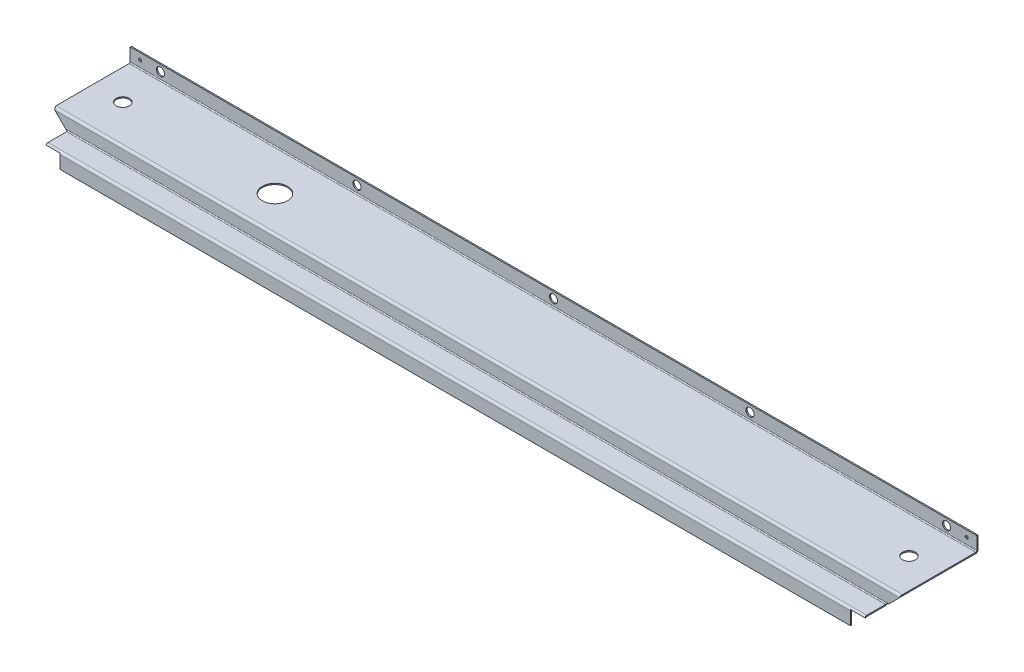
ISO-10303-21;
HEADER;
FILE_DESCRIPTION(('STEP AP214'),'2;1');
FILE_NAME('part.step','',(''),(''),'','','');
FILE_SCHEMA(('AUTOMOTIVE_DESIGN { 1 0 10303 214 1 1 1 1 }'));
ENDSEC;
DATA;
#1=APPLICATION_CONTEXT('core data for automotive mechanical design processes');
#2=APPLICATION_PROTOCOL_DEFINITION('international standard','automotive_design',2000,#1);
#3=PRODUCT_CONTEXT('',#1,'mechanical');
#4=PRODUCT('Part','Part','',(#3));
#5=PRODUCT_RELATED_PRODUCT_CATEGORY('part','',(#4));
#6=PRODUCT_DEFINITION_FORMATION('','',#4);
#7=PRODUCT_DEFINITION_CONTEXT('part definition',#1,'design');
#8=PRODUCT_DEFINITION('design','',#6,#7);
#9=PRODUCT_DEFINITION_SHAPE('','',#8);
#10=(LENGTH_UNIT() NAMED_UNIT(*) SI_UNIT(.MILLI.,.METRE.));
#11=(NAMED_UNIT(*) PLANE_ANGLE_UNIT() SI_UNIT($,.RADIAN.));
#12=(NAMED_UNIT(*) SI_UNIT($,.STERADIAN.) SOLID_ANGLE_UNIT());
#13=UNCERTAINTY_MEASURE_WITH_UNIT(LENGTH_MEASURE(1.E-05),#10,'distance_accuracy_value','');
#14=(GEOMETRIC_REPRESENTATION_CONTEXT(3) GLOBAL_UNCERTAINTY_ASSIGNED_CONTEXT((#13)) GLOBAL_UNIT_ASSIGNED_CONTEXT((#10,
#11,#12)) REPRESENTATION_CONTEXT('',''));
#15=CARTESIAN_POINT('',(0.,0.,0.));
#16=DIRECTION('',(0.,0.,1.));
#17=DIRECTION('',(1.,0.,0.));
#18=AXIS2_PLACEMENT_3D('',#15,#16,#17);
#19=CARTESIAN_POINT('',(0.,0.,77.0000000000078));
#20=DIRECTION('',(0.,0.,1.));
#21=DIRECTION('',(0.,-1.,0.));
#22=AXIS2_PLACEMENT_3D('',#19,#20,#21);
#23=PLANE('',#22);
#24=DIRECTION('',(1.,0.,0.));
#25=VECTOR('',#24,1.);
#26=CARTESIAN_POINT('',(406.9,971.8,77.0000000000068));
#27=LINE('',#26,#25);
#28=CARTESIAN_POINT('',(406.9,971.8,77.0000000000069));
#29=VERTEX_POINT('',#28);
#30=CARTESIAN_POINT('',(-405.9,971.8,77.0000000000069));
#31=VERTEX_POINT('',#30);
#32=EDGE_CURVE('E340',#29,#31,#27,.F.);
#33=ORIENTED_EDGE('',*,*,#32,.F.);
#34=DIRECTION('',(1.,0.,0.));
#35=VECTOR('',#34,1.);
#36=CARTESIAN_POINT('',(406.9,971.8,77.0000000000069));
#37=LINE('',#36,#35);
#38=CARTESIAN_POINT('',(409.1,971.8,77.0000000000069));
#39=VERTEX_POINT('',#38);
#40=EDGE_CURVE('E315',#29,#39,#37,.T.);
#41=ORIENTED_EDGE('',*,*,#40,.T.);
#42=DIRECTION('',(-0.70710678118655,-0.707106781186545,0.));
#43=VECTOR('',#42,1.);
#44=CARTESIAN_POINT('',(406.9,969.6,77.0000000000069));
#45=LINE('',#44,#43);
#46=CARTESIAN_POINT('',(419.7,982.4,77.0000000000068));
#47=VERTEX_POINT('',#46);
#48=EDGE_CURVE('E363',#47,#39,#45,.T.);
#49=ORIENTED_EDGE('',*,*,#48,.F.);
#50=DIRECTION('',(-1.,0.,0.));
#51=VECTOR('',#50,1.);
#52=CARTESIAN_POINT('',(0.,982.4,77.0000000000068));
#53=LINE('',#52,#51);
#54=CARTESIAN_POINT('',(-418.7,982.4,77.0000000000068));
#55=VERTEX_POINT('',#54);
#56=EDGE_CURVE('E373',#47,#55,#53,.T.);
#57=ORIENTED_EDGE('',*,*,#56,.T.);
#58=DIRECTION('',(-0.70710678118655,0.707106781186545,0.));
#59=VECTOR('',#58,1.);
#60=CARTESIAN_POINT('',(-419.7,983.4,77.0000000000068));
#61=LINE('',#60,#59);
#62=CARTESIAN_POINT('',(-405.9,969.6,77.0000000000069));
#63=VERTEX_POINT('',#62);
#64=EDGE_CURVE('E366',#63,#55,#61,.T.);
#65=ORIENTED_EDGE('',*,*,#64,.F.);
#66=DIRECTION('',(0.,-1.,0.));
#67=VECTOR('',#66,1.);
#68=CARTESIAN_POINT('',(-405.9,971.8,77.0000000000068));
#69=LINE('',#68,#67);
#70=CARTESIAN_POINT('',(-405.9,969.840408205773,77.0000000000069));
#71=VERTEX_POINT('',#70);
#72=EDGE_CURVE('E345',#71,#63,#69,.T.);
#73=ORIENTED_EDGE('',*,*,#72,.F.);
#74=EDGE_CURVE('E353',#31,#71,#69,.T.);
#75=ORIENTED_EDGE('',*,*,#74,.F.);
#76=EDGE_LOOP('',(#33,#41,#49,#57,#65,#73,#75));
#77=FACE_BOUND('',#76,.T.);
#78=ADVANCED_FACE('F121',(#77),#23,.T.);
#79=CARTESIAN_POINT('',(0.,0.,75.8000000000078));
#80=DIRECTION('',(0.,0.,1.));
#81=DIRECTION('',(0.,-1.,0.));
#82=AXIS2_PLACEMENT_3D('',#79,#80,#81);
#83=PLANE('',#82);
#84=DIRECTION('',(1.,0.,0.));
#85=VECTOR('',#84,1.);
#86=CARTESIAN_POINT('',(0.,971.8,75.8000000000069));
#87=LINE('',#86,#85);
#88=CARTESIAN_POINT('',(406.9,971.8,75.8000000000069));
#89=VERTEX_POINT('',#88);
#90=CARTESIAN_POINT('',(409.1,971.8,75.8000000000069));
#91=VERTEX_POINT('',#90);
#92=EDGE_CURVE('E312',#89,#91,#87,.T.);
#93=ORIENTED_EDGE('',*,*,#92,.F.);
#94=DIRECTION('',(1.,0.,0.));
#95=VECTOR('',#94,1.);
#96=CARTESIAN_POINT('',(406.9,971.8,75.8000000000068));
#97=LINE('',#96,#95);
#98=CARTESIAN_POINT('',(-405.9,971.8,75.8000000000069));
#99=VERTEX_POINT('',#98);
#100=EDGE_CURVE('E323',#89,#99,#97,.F.);
#101=ORIENTED_EDGE('',*,*,#100,.T.);
#102=DIRECTION('',(0.,1.,0.));
#103=VECTOR('',#102,1.);
#104=CARTESIAN_POINT('',(-405.9,0.,75.8000000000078));
#105=LINE('',#104,#103);
#106=CARTESIAN_POINT('',(-405.9,969.6,75.8000000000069));
#107=VERTEX_POINT('',#106);
#108=EDGE_CURVE('E356',#107,#99,#105,.T.);
#109=ORIENTED_EDGE('',*,*,#108,.F.);
#110=DIRECTION('',(0.70710678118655,-0.707106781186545,0.));
#111=VECTOR('',#110,1.);
#112=CARTESIAN_POINT('',(281.850000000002,281.850000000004,75.8000000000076));
#113=LINE('',#112,#111);
#114=CARTESIAN_POINT('',(-418.7,982.4,75.8000000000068));
#115=VERTEX_POINT('',#114);
#116=EDGE_CURVE('E370',#107,#115,#113,.F.);
#117=ORIENTED_EDGE('',*,*,#116,.T.);
#118=DIRECTION('',(1.,0.,0.));
#119=VECTOR('',#118,1.);
#120=CARTESIAN_POINT('',(419.7,982.4,75.8000000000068));
#121=LINE('',#120,#119);
#122=CARTESIAN_POINT('',(419.7,982.4,75.8000000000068));
#123=VERTEX_POINT('',#122);
#124=EDGE_CURVE('E379',#123,#115,#121,.F.);
#125=ORIENTED_EDGE('',*,*,#124,.F.);
#126=DIRECTION('',(0.70710678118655,0.707106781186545,0.));
#127=VECTOR('',#126,1.);
#128=CARTESIAN_POINT('',(-281.350000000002,281.350000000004,75.8000000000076));
#129=LINE('',#128,#127);
#130=EDGE_CURVE('E327',#123,#91,#129,.F.);
#131=ORIENTED_EDGE('',*,*,#130,.T.);
#132=EDGE_LOOP('',(#93,#101,#109,#117,#125,#131));
#133=FACE_BOUND('',#132,.T.);
#134=ADVANCED_FACE('F321',(#133),#83,.F.);
#135=CARTESIAN_POINT('',(406.9,969.6,77.0000000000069));
#136=DIRECTION('',(0.707106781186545,-0.70710678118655,0.));
#137=DIRECTION('',(0.70710678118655,0.707106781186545,0.));
#138=AXIS2_PLACEMENT_3D('',#135,#136,#137);
#139=PLANE('',#138);
#140=ORIENTED_EDGE('',*,*,#48,.T.);
#141=DIRECTION('',(0.,0.,1.));
#142=VECTOR('',#141,1.);
#143=CARTESIAN_POINT('',(409.1,971.8,77.0000000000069));
#144=LINE('',#143,#142);
#145=EDGE_CURVE('E317',#39,#91,#144,.F.);
#146=ORIENTED_EDGE('',*,*,#145,.T.);
#147=ORIENTED_EDGE('',*,*,#130,.F.);
#148=DIRECTION('',(0.,0.,1.));
#149=VECTOR('',#148,1.);
#150=CARTESIAN_POINT('',(419.7,982.4,77.0000000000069));
#151=LINE('',#150,#149);
#152=EDGE_CURVE('E358',#123,#47,#151,.T.);
#153=ORIENTED_EDGE('',*,*,#152,.T.);
#154=EDGE_LOOP('',(#140,#146,#147,#153));
#155=FACE_BOUND('',#154,.T.);
#156=ADVANCED_FACE('F513',(#155),#139,.T.);
#157=CARTESIAN_POINT('',(406.9,968.6,96.6));
#158=DIRECTION('',(1.,0.,0.));
#159=DIRECTION('',(0.,0.,-1.));
#160=AXIS2_PLACEMENT_3D('',#157,#158,#159);
#161=PLANE('',#160);
#162=CARTESIAN_POINT('',(406.9,968.6,96.6));
#163=DIRECTION('',(-1.,0.,0.));
#164=DIRECTION('',(0.,0.,1.));
#165=AXIS2_PLACEMENT_3D('',#162,#163,#164);
#166=CIRCLE('',#165,2.2);
#167=CARTESIAN_POINT('',(406.9,970.8,96.6));
#168=VERTEX_POINT('',#167);
#169=CARTESIAN_POINT('',(406.9,969.6,98.5595917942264));
#170=VERTEX_POINT('',#169);
#171=EDGE_CURVE('E652',#168,#170,#166,.F.);
#172=ORIENTED_EDGE('',*,*,#171,.T.);
#173=DIRECTION('',(0.,0.454545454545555,0.890723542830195));
#174=VECTOR('',#173,1.);
#175=CARTESIAN_POINT('',(406.9,969.6,98.5595917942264));
#176=LINE('',#175,#174);
#177=CARTESIAN_POINT('',(406.9,969.054545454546,97.4907235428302));
#178=VERTEX_POINT('',#177);
#179=EDGE_CURVE('E559',#170,#178,#176,.F.);
#180=ORIENTED_EDGE('',*,*,#179,.T.);
#181=CARTESIAN_POINT('',(406.9,968.6,96.6));
#182=DIRECTION('',(-1.,0.,0.));
#183=DIRECTION('',(0.,0.,1.));
#184=AXIS2_PLACEMENT_3D('',#181,#182,#183);
#185=CIRCLE('',#184,1.);
#186=CARTESIAN_POINT('',(406.9,969.6,96.6));
#187=VERTEX_POINT('',#186);
#188=EDGE_CURVE('E658',#187,#178,#185,.F.);
#189=ORIENTED_EDGE('',*,*,#188,.F.);
#190=DIRECTION('',(0.,1.,0.));
#191=VECTOR('',#190,1.);
#192=CARTESIAN_POINT('',(406.9,969.6,96.6));
#193=LINE('',#192,#191);
#194=EDGE_CURVE('E664',#187,#168,#193,.T.);
#195=ORIENTED_EDGE('',*,*,#194,.T.);
#196=EDGE_LOOP('',(#172,#180,#189,#195));
#197=FACE_BOUND('',#196,.T.);
#198=ADVANCED_FACE('F518',(#197),#161,.T.);
#199=CARTESIAN_POINT('',(-405.9,968.6,96.6));
#200=DIRECTION('',(1.,0.,0.));
#201=DIRECTION('',(0.,0.,-1.));
#202=AXIS2_PLACEMENT_3D('',#199,#200,#201);
#203=PLANE('',#202);
#204=CARTESIAN_POINT('',(-405.9,968.6,96.6));
#205=DIRECTION('',(-1.,0.,0.));
#206=DIRECTION('',(0.,0.,1.));
#207=AXIS2_PLACEMENT_3D('',#204,#205,#206);
#208=CIRCLE('',#207,1.);
#209=CARTESIAN_POINT('',(-405.9,969.054545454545,97.4907235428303));
#210=VERTEX_POINT('',#209);
#211=CARTESIAN_POINT('',(-405.9,969.6,96.6));
#212=VERTEX_POINT('',#211);
#213=EDGE_CURVE('E640',#210,#212,#208,.T.);
#214=ORIENTED_EDGE('',*,*,#213,.F.);
#215=DIRECTION('',(0.,0.454545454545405,0.890723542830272));
#216=VECTOR('',#215,1.);
#217=CARTESIAN_POINT('',(-405.9,969.6,98.5595917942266));
#218=LINE('',#217,#216);
#219=CARTESIAN_POINT('',(-405.9,969.6,98.5595917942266));
#220=VERTEX_POINT('',#219);
#221=EDGE_CURVE('E578',#220,#210,#218,.F.);
#222=ORIENTED_EDGE('',*,*,#221,.F.);
#223=CARTESIAN_POINT('',(-405.9,968.6,96.6));
#224=DIRECTION('',(-1.,0.,0.));
#225=DIRECTION('',(0.,0.,1.));
#226=AXIS2_PLACEMENT_3D('',#223,#224,#225);
#227=CIRCLE('',#226,2.2);
#228=CARTESIAN_POINT('',(-405.9,970.8,96.6));
#229=VERTEX_POINT('',#228);
#230=EDGE_CURVE('E653',#220,#229,#227,.T.);
#231=ORIENTED_EDGE('',*,*,#230,.T.);
#232=DIRECTION('',(0.,1.,0.));
#233=VECTOR('',#232,1.);
#234=CARTESIAN_POINT('',(-405.9,969.6,96.6));
#235=LINE('',#234,#233);
#236=EDGE_CURVE('E656',#212,#229,#235,.T.);
#237=ORIENTED_EDGE('',*,*,#236,.F.);
#238=EDGE_LOOP('',(#214,#222,#231,#237));
#239=FACE_BOUND('',#238,.T.);
#240=ADVANCED_FACE('F523',(#239),#203,.F.);
#241=CARTESIAN_POINT('',(-405.9,968.6,96.6));
#242=DIRECTION('',(-1.,0.,0.));
#243=DIRECTION('',(0.,0.,1.));
#244=AXIS2_PLACEMENT_3D('',#241,#242,#243);
#245=CYLINDRICAL_SURFACE('',#244,2.2);
#246=CARTESIAN_POINT('',(392.9,968.6,96.6));
#247=DIRECTION('',(-1.,0.,0.));
#248=DIRECTION('',(0.,0.,1.));
#249=AXIS2_PLACEMENT_3D('',#246,#247,#248);
#250=CIRCLE('',#249,2.2);
#251=CARTESIAN_POINT('',(392.9,969.6,98.5595917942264));
#252=VERTEX_POINT('',#251);
#253=CARTESIAN_POINT('',(392.9,968.6,98.8));
#254=VERTEX_POINT('',#253);
#255=EDGE_CURVE('E552',#252,#254,#250,.F.);
#256=ORIENTED_EDGE('',*,*,#255,.F.);
#257=DIRECTION('',(-1.,0.,0.));
#258=VECTOR('',#257,1.);
#259=CARTESIAN_POINT('',(-405.9,969.6,98.5595917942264));
#260=LINE('',#259,#258);
#261=EDGE_CURVE('E540',#170,#252,#260,.T.);
#262=ORIENTED_EDGE('',*,*,#261,.F.);
#263=ORIENTED_EDGE('',*,*,#171,.F.);
#264=DIRECTION('',(-1.,0.,0.));
#265=VECTOR('',#264,1.);
#266=CARTESIAN_POINT('',(-405.9,970.8,96.6));
#267=LINE('',#266,#265);
#268=EDGE_CURVE('E649',#229,#168,#267,.F.);
#269=ORIENTED_EDGE('',*,*,#268,.F.);
#270=ORIENTED_EDGE('',*,*,#230,.F.);
#271=DIRECTION('',(-1.,0.,0.));
#272=VECTOR('',#271,1.);
#273=CARTESIAN_POINT('',(-405.9,969.6,98.5595917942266));
#274=LINE('',#273,#272);
#275=CARTESIAN_POINT('',(-391.9,969.6,98.5595917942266));
#276=VERTEX_POINT('',#275);
#277=EDGE_CURVE('E570',#276,#220,#274,.T.);
#278=ORIENTED_EDGE('',*,*,#277,.F.);
#279=CARTESIAN_POINT('',(-391.9,968.6,96.6));
#280=DIRECTION('',(1.,0.,0.));
#281=DIRECTION('',(0.,0.,-1.));
#282=AXIS2_PLACEMENT_3D('',#279,#280,#281);
#283=CIRCLE('',#282,2.2);
#284=CARTESIAN_POINT('',(-391.9,968.6,98.800000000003));
#285=VERTEX_POINT('',#284);
#286=EDGE_CURVE('E547',#285,#276,#283,.F.);
#287=ORIENTED_EDGE('',*,*,#286,.F.);
#288=DIRECTION('',(-1.,0.,0.));
#289=VECTOR('',#288,1.);
#290=CARTESIAN_POINT('',(0.,968.6,98.8));
#291=LINE('',#290,#289);
#292=EDGE_CURVE('E644',#254,#285,#291,.T.);
#293=ORIENTED_EDGE('',*,*,#292,.F.);
#294=EDGE_LOOP('',(#256,#262,#263,#269,#270,#278,#287,#293));
#295=FACE_BOUND('',#294,.T.);
#296=ADVANCED_FACE('F715',(#295),#245,.T.);
#297=CARTESIAN_POINT('',(-405.9,968.6,96.6));
#298=DIRECTION('',(-1.,0.,0.));
#299=DIRECTION('',(0.,0.,1.));
#300=AXIS2_PLACEMENT_3D('',#297,#298,#299);
#301=CYLINDRICAL_SURFACE('',#300,1.);
#302=DIRECTION('',(-1.,0.,0.));
#303=VECTOR('',#302,1.);
#304=CARTESIAN_POINT('',(-405.9,969.054545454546,97.4907235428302));
#305=LINE('',#304,#303);
#306=CARTESIAN_POINT('',(392.9,969.054545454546,97.4907235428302));
#307=VERTEX_POINT('',#306);
#308=EDGE_CURVE('E548',#178,#307,#305,.T.);
#309=ORIENTED_EDGE('',*,*,#308,.T.);
#310=CARTESIAN_POINT('',(392.9,968.6,96.6));
#311=DIRECTION('',(-1.,0.,0.));
#312=DIRECTION('',(0.,0.,1.));
#313=AXIS2_PLACEMENT_3D('',#310,#311,#312);
#314=CIRCLE('',#313,1.);
#315=CARTESIAN_POINT('',(392.9,968.6,97.6));
#316=VERTEX_POINT('',#315);
#317=EDGE_CURVE('E551',#307,#316,#314,.F.);
#318=ORIENTED_EDGE('',*,*,#317,.T.);
#319=DIRECTION('',(1.,0.,0.));
#320=VECTOR('',#319,1.);
#321=CARTESIAN_POINT('',(406.9,968.6,97.6));
#322=LINE('',#321,#320);
#323=CARTESIAN_POINT('',(-391.9,968.6,97.6));
#324=VERTEX_POINT('',#323);
#325=EDGE_CURVE('E628',#316,#324,#322,.F.);
#326=ORIENTED_EDGE('',*,*,#325,.T.);
#327=CARTESIAN_POINT('',(-391.9,968.6,96.6));
#328=DIRECTION('',(-1.,0.,0.));
#329=DIRECTION('',(0.,0.,1.));
#330=AXIS2_PLACEMENT_3D('',#327,#328,#329);
#331=CIRCLE('',#330,1.);
#332=CARTESIAN_POINT('',(-391.9,969.054545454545,97.4907235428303));
#333=VERTEX_POINT('',#332);
#334=EDGE_CURVE('E566',#324,#333,#331,.T.);
#335=ORIENTED_EDGE('',*,*,#334,.T.);
#336=DIRECTION('',(-1.,0.,0.));
#337=VECTOR('',#336,1.);
#338=CARTESIAN_POINT('',(-405.9,969.054545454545,97.4907235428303));
#339=LINE('',#338,#337);
#340=EDGE_CURVE('E569',#333,#210,#339,.T.);
#341=ORIENTED_EDGE('',*,*,#340,.T.);
#342=ORIENTED_EDGE('',*,*,#213,.T.);
#343=DIRECTION('',(-1.,0.,0.));
#344=VECTOR('',#343,1.);
#345=CARTESIAN_POINT('',(-405.9,969.6,96.6));
#346=LINE('',#345,#344);
#347=EDGE_CURVE('E661',#212,#187,#346,.F.);
#348=ORIENTED_EDGE('',*,*,#347,.T.);
#349=ORIENTED_EDGE('',*,*,#188,.T.);
#350=EDGE_LOOP('',(#309,#318,#326,#335,#341,#342,#348,#349));
#351=FACE_BOUND('',#350,.T.);
#352=ADVANCED_FACE('F706',(#351),#301,.F.);
#353=CARTESIAN_POINT('',(0.,3.0226052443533E-13,98.800000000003));
#354=DIRECTION('',(0.,0.,1.));
#355=DIRECTION('',(0.,-1.,0.));
#356=AXIS2_PLACEMENT_3D('',#353,#354,#355);
#357=PLANE('',#356);
#358=DIRECTION('',(-1.,0.,0.));
#359=VECTOR('',#358,1.);
#360=CARTESIAN_POINT('',(-405.9,955.8,98.8000000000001));
#361=LINE('',#360,#359);
#362=CARTESIAN_POINT('',(392.9,955.8,98.8000000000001));
#363=VERTEX_POINT('',#362);
#364=CARTESIAN_POINT('',(-391.9,955.8,98.8000000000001));
#365=VERTEX_POINT('',#364);
#366=EDGE_CURVE('E637',#363,#365,#361,.T.);
#367=ORIENTED_EDGE('',*,*,#366,.F.);
#368=DIRECTION('',(0.,1.,0.));
#369=VECTOR('',#368,1.);
#370=CARTESIAN_POINT('',(392.9,955.8,98.8000000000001));
#371=LINE('',#370,#369);
#372=EDGE_CURVE('E137',#363,#254,#371,.T.);
#373=ORIENTED_EDGE('',*,*,#372,.T.);
#374=ORIENTED_EDGE('',*,*,#292,.T.);
#375=DIRECTION('',(0.,-1.,0.));
#376=VECTOR('',#375,1.);
#377=CARTESIAN_POINT('',(-391.9,962.2,98.8000000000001));
#378=LINE('',#377,#376);
#379=EDGE_CURVE('E543',#365,#285,#378,.F.);
#380=ORIENTED_EDGE('',*,*,#379,.F.);
#381=EDGE_LOOP('',(#367,#373,#374,#380));
#382=FACE_BOUND('',#381,.T.);
#383=ADVANCED_FACE('F722',(#382),#357,.T.);
#384=CARTESIAN_POINT('',(0.,2.98070746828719E-13,97.600000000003));
#385=DIRECTION('',(0.,0.,1.));
#386=DIRECTION('',(0.,-1.,0.));
#387=AXIS2_PLACEMENT_3D('',#384,#385,#386);
#388=PLANE('',#387);
#389=DIRECTION('',(0.,1.,0.));
#390=VECTOR('',#389,1.);
#391=CARTESIAN_POINT('',(392.9,962.2,97.6000000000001));
#392=LINE('',#391,#390);
#393=CARTESIAN_POINT('',(392.9,955.8,97.6000000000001));
#394=VERTEX_POINT('',#393);
#395=EDGE_CURVE('E316',#394,#316,#392,.T.);
#396=ORIENTED_EDGE('',*,*,#395,.F.);
#397=DIRECTION('',(1.,0.,0.));
#398=VECTOR('',#397,1.);
#399=CARTESIAN_POINT('',(0.,955.8,97.6000000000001));
#400=LINE('',#399,#398);
#401=CARTESIAN_POINT('',(-391.9,955.8,97.6000000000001));
#402=VERTEX_POINT('',#401);
#403=EDGE_CURVE('E641',#394,#402,#400,.F.);
#404=ORIENTED_EDGE('',*,*,#403,.T.);
#405=DIRECTION('',(0.,1.,0.));
#406=VECTOR('',#405,1.);
#407=CARTESIAN_POINT('',(-391.9,955.8,97.6000000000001));
#408=LINE('',#407,#406);
#409=EDGE_CURVE('E145',#402,#324,#408,.T.);
#410=ORIENTED_EDGE('',*,*,#409,.T.);
#411=ORIENTED_EDGE('',*,*,#325,.F.);
#412=EDGE_LOOP('',(#396,#404,#410,#411));
#413=FACE_BOUND('',#412,.T.);
#414=ADVANCED_FACE('F731',(#413),#388,.F.);
#415=CARTESIAN_POINT('',(-405.9,955.8,98.8000000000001));
#416=DIRECTION('',(0.,-1.,0.));
#417=DIRECTION('',(0.,0.,-1.));
#418=AXIS2_PLACEMENT_3D('',#415,#416,#417);
#419=PLANE('',#418);
#420=ORIENTED_EDGE('',*,*,#403,.F.);
#421=DIRECTION('',(0.,0.,-1.));
#422=VECTOR('',#421,1.);
#423=CARTESIAN_POINT('',(392.9,955.8,98.8000000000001));
#424=LINE('',#423,#422);
#425=EDGE_CURVE('E537',#394,#363,#424,.F.);
#426=ORIENTED_EDGE('',*,*,#425,.T.);
#427=ORIENTED_EDGE('',*,*,#366,.T.);
#428=DIRECTION('',(0.,0.,1.));
#429=VECTOR('',#428,1.);
#430=CARTESIAN_POINT('',(-391.9,955.8,97.6000000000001));
#431=LINE('',#430,#429);
#432=EDGE_CURVE('E542',#365,#402,#431,.F.);
#433=ORIENTED_EDGE('',*,*,#432,.T.);
#434=EDGE_LOOP('',(#420,#426,#427,#433));
#435=FACE_BOUND('',#434,.T.);
#436=ADVANCED_FACE('F726',(#435),#419,.T.);
#437=CARTESIAN_POINT('',(-405.9,969.6,77.0000000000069));
#438=DIRECTION('',(1.,0.,0.));
#439=DIRECTION('',(0.,0.,-1.));
#440=AXIS2_PLACEMENT_3D('',#437,#438,#439);
#441=PLANE('',#440);
#442=ORIENTED_EDGE('',*,*,#236,.T.);
#443=DIRECTION('',(0.,0.,1.));
#444=VECTOR('',#443,1.);
#445=CARTESIAN_POINT('',(-405.9,970.8,77.0000000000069));
#446=LINE('',#445,#444);
#447=CARTESIAN_POINT('',(-405.9,970.8,78.0000000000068));
#448=VERTEX_POINT('',#447);
#449=EDGE_CURVE('E676',#229,#448,#446,.F.);
#450=ORIENTED_EDGE('',*,*,#449,.T.);
#451=DIRECTION('',(0.,1.,0.));
#452=VECTOR('',#451,1.);
#453=CARTESIAN_POINT('',(-405.9,969.6,78.0000000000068));
#454=LINE('',#453,#452);
#455=CARTESIAN_POINT('',(-405.9,969.6,78.0000000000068));
#456=VERTEX_POINT('',#455);
#457=EDGE_CURVE('E343',#448,#456,#454,.F.);
#458=ORIENTED_EDGE('',*,*,#457,.T.);
#459=DIRECTION('',(0.,0.,-1.));
#460=VECTOR('',#459,1.);
#461=CARTESIAN_POINT('',(-405.9,969.6,0.));
#462=LINE('',#461,#460);
#463=EDGE_CURVE('E671',#212,#456,#462,.T.);
#464=ORIENTED_EDGE('',*,*,#463,.F.);
#465=EDGE_LOOP('',(#442,#450,#458,#464));
#466=FACE_BOUND('',#465,.T.);
#467=ADVANCED_FACE('F687',(#466),#441,.F.);
#468=CARTESIAN_POINT('',(406.9,969.6,98.8));
#469=DIRECTION('',(-1.,0.,0.));
#470=DIRECTION('',(0.,0.,1.));
#471=AXIS2_PLACEMENT_3D('',#468,#469,#470);
#472=PLANE('',#471);
#473=ORIENTED_EDGE('',*,*,#194,.F.);
#474=DIRECTION('',(0.,0.,1.));
#475=VECTOR('',#474,1.);
#476=CARTESIAN_POINT('',(406.9,969.6,0.));
#477=LINE('',#476,#475);
#478=CARTESIAN_POINT('',(406.9,969.6,78.0000000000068));
#479=VERTEX_POINT('',#478);
#480=EDGE_CURVE('E352',#479,#187,#477,.T.);
#481=ORIENTED_EDGE('',*,*,#480,.F.);
#482=DIRECTION('',(0.,1.,0.));
#483=VECTOR('',#482,1.);
#484=CARTESIAN_POINT('',(406.9,970.8,78.0000000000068));
#485=LINE('',#484,#483);
#486=CARTESIAN_POINT('',(406.9,970.8,78.0000000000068));
#487=VERTEX_POINT('',#486);
#488=EDGE_CURVE('E304',#487,#479,#485,.F.);
#489=ORIENTED_EDGE('',*,*,#488,.F.);
#490=DIRECTION('',(0.,0.,-1.));
#491=VECTOR('',#490,1.);
#492=CARTESIAN_POINT('',(406.9,970.8,98.8));
#493=LINE('',#492,#491);
#494=EDGE_CURVE('E673',#487,#168,#493,.F.);
#495=ORIENTED_EDGE('',*,*,#494,.T.);
#496=EDGE_LOOP('',(#473,#481,#489,#495));
#497=FACE_BOUND('',#496,.T.);
#498=ADVANCED_FACE('F699',(#497),#472,.F.);
#499=CARTESIAN_POINT('',(0.,969.6,0.));
#500=DIRECTION('',(0.,1.,0.));
#501=DIRECTION('',(0.,0.,1.));
#502=AXIS2_PLACEMENT_3D('',#499,#500,#501);
#503=PLANE('',#502);
#504=ORIENTED_EDGE('',*,*,#347,.F.);
#505=ORIENTED_EDGE('',*,*,#463,.T.);
#506=DIRECTION('',(1.,0.,0.));
#507=VECTOR('',#506,1.);
#508=CARTESIAN_POINT('',(-405.9,969.6,78.0000000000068));
#509=LINE('',#508,#507);
#510=EDGE_CURVE('E678',#479,#456,#509,.F.);
#511=ORIENTED_EDGE('',*,*,#510,.F.);
#512=ORIENTED_EDGE('',*,*,#480,.T.);
#513=EDGE_LOOP('',(#504,#505,#511,#512));
#514=FACE_BOUND('',#513,.T.);
#515=ADVANCED_FACE('F703',(#514),#503,.F.);
#516=CARTESIAN_POINT('',(0.,970.8,0.));
#517=DIRECTION('',(0.,1.,0.));
#518=DIRECTION('',(0.,0.,1.));
#519=AXIS2_PLACEMENT_3D('',#516,#517,#518);
#520=PLANE('',#519);
#521=ORIENTED_EDGE('',*,*,#449,.F.);
#522=ORIENTED_EDGE('',*,*,#268,.T.);
#523=ORIENTED_EDGE('',*,*,#494,.F.);
#524=DIRECTION('',(1.,0.,0.));
#525=VECTOR('',#524,1.);
#526=CARTESIAN_POINT('',(-405.9,970.8,78.0000000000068));
#527=LINE('',#526,#525);
#528=EDGE_CURVE('E680',#448,#487,#527,.T.);
#529=ORIENTED_EDGE('',*,*,#528,.F.);
#530=EDGE_LOOP('',(#521,#522,#523,#529));
#531=FACE_BOUND('',#530,.T.);
#532=ADVANCED_FACE('F695',(#531),#520,.T.);
#533=CARTESIAN_POINT('',(-405.9,971.8,77.0000000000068));
#534=DIRECTION('',(1.,0.,0.));
#535=DIRECTION('',(0.,0.,-1.));
#536=AXIS2_PLACEMENT_3D('',#533,#534,#535);
#537=PLANE('',#536);
#538=ORIENTED_EDGE('',*,*,#108,.T.);
#539=CARTESIAN_POINT('',(-405.9,971.8,78.0000000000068));
#540=DIRECTION('',(1.,0.,0.));
#541=DIRECTION('',(0.,0.,-1.));
#542=AXIS2_PLACEMENT_3D('',#539,#540,#541);
#543=CIRCLE('',#542,2.2);
#544=EDGE_CURVE('E333',#99,#71,#543,.F.);
#545=ORIENTED_EDGE('',*,*,#544,.T.);
#546=ORIENTED_EDGE('',*,*,#72,.T.);
#547=DIRECTION('',(0.,0.,-1.));
#548=VECTOR('',#547,1.);
#549=CARTESIAN_POINT('',(-405.9,969.6,77.0000000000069));
#550=LINE('',#549,#548);
#551=EDGE_CURVE('E359',#63,#107,#550,.T.);
#552=ORIENTED_EDGE('',*,*,#551,.T.);
#553=EDGE_LOOP('',(#538,#545,#546,#552));
#554=FACE_BOUND('',#553,.T.);
#555=ADVANCED_FACE('F471',(#554),#537,.T.);
#556=CARTESIAN_POINT('',(420.7,983.4,77.0000000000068));
#557=DIRECTION('',(-1.,0.,0.));
#558=DIRECTION('',(0.,0.,1.));
#559=AXIS2_PLACEMENT_3D('',#556,#557,#558);
#560=PLANE('',#559);
#561=DIRECTION('',(0.,1.,0.));
#562=VECTOR('',#561,1.);
#563=CARTESIAN_POINT('',(420.7,983.4,74.8000000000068));
#564=LINE('',#563,#562);
#565=CARTESIAN_POINT('',(420.7,983.4,74.8000000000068));
#566=VERTEX_POINT('',#565);
#567=CARTESIAN_POINT('',(420.7,984.6,74.8000000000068));
#568=VERTEX_POINT('',#567);
#569=EDGE_CURVE('E391',#566,#568,#564,.T.);
#570=ORIENTED_EDGE('',*,*,#569,.F.);
#571=DIRECTION('',(0.,0.,1.));
#572=VECTOR('',#571,1.);
#573=CARTESIAN_POINT('',(420.7,983.4,2.87653138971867E-12));
#574=LINE('',#573,#572);
#575=CARTESIAN_POINT('',(420.7,983.4,2.19999999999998));
#576=VERTEX_POINT('',#575);
#577=EDGE_CURVE('E1398',#576,#566,#574,.T.);
#578=ORIENTED_EDGE('',*,*,#577,.F.);
#579=DIRECTION('',(0.,1.,0.));
#580=VECTOR('',#579,1.);
#581=CARTESIAN_POINT('',(420.7,984.6,2.19999999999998));
#582=LINE('',#581,#580);
#583=CARTESIAN_POINT('',(420.7,984.6,2.19999999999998));
#584=VERTEX_POINT('',#583);
#585=EDGE_CURVE('E1414',#584,#576,#582,.F.);
#586=ORIENTED_EDGE('',*,*,#585,.F.);
#587=DIRECTION('',(0.,0.,-1.));
#588=VECTOR('',#587,1.);
#589=CARTESIAN_POINT('',(420.7,984.6,77.0000000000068));
#590=LINE('',#589,#588);
#591=EDGE_CURVE('E1407',#584,#568,#590,.F.);
#592=ORIENTED_EDGE('',*,*,#591,.T.);
#593=EDGE_LOOP('',(#570,#578,#586,#592));
#594=FACE_BOUND('',#593,.T.);
#595=ADVANCED_FACE('F467',(#594),#560,.F.);
#596=CARTESIAN_POINT('',(-419.7,983.4,1.2));
#597=DIRECTION('',(1.,0.,0.));
#598=DIRECTION('',(0.,0.,-1.));
#599=AXIS2_PLACEMENT_3D('',#596,#597,#598);
#600=PLANE('',#599);
#601=DIRECTION('',(0.,1.,0.));
#602=VECTOR('',#601,1.);
#603=CARTESIAN_POINT('',(-419.7,983.4,74.8000000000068));
#604=LINE('',#603,#602);
#605=CARTESIAN_POINT('',(-419.7,983.4,74.8000000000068));
#606=VERTEX_POINT('',#605);
#607=CARTESIAN_POINT('',(-419.7,984.6,74.8000000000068));
#608=VERTEX_POINT('',#607);
#609=EDGE_CURVE('E395',#606,#608,#604,.T.);
#610=ORIENTED_EDGE('',*,*,#609,.T.);
#611=DIRECTION('',(0.,0.,1.));
#612=VECTOR('',#611,1.);
#613=CARTESIAN_POINT('',(-419.7,984.6,1.2));
#614=LINE('',#613,#612);
#615=CARTESIAN_POINT('',(-419.7,984.6,2.19999999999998));
#616=VERTEX_POINT('',#615);
#617=EDGE_CURVE('E1406',#608,#616,#614,.F.);
#618=ORIENTED_EDGE('',*,*,#617,.T.);
#619=DIRECTION('',(0.,1.,0.));
#620=VECTOR('',#619,1.);
#621=CARTESIAN_POINT('',(-419.7,983.4,2.19999999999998));
#622=LINE('',#621,#620);
#623=CARTESIAN_POINT('',(-419.7,983.4,2.19999999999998));
#624=VERTEX_POINT('',#623);
#625=EDGE_CURVE('E394',#616,#624,#622,.F.);
#626=ORIENTED_EDGE('',*,*,#625,.T.);
#627=DIRECTION('',(0.,0.,-1.));
#628=VECTOR('',#627,1.);
#629=CARTESIAN_POINT('',(-419.7,983.4,2.87653138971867E-12));
#630=LINE('',#629,#628);
#631=EDGE_CURVE('E442',#606,#624,#630,.T.);
#632=ORIENTED_EDGE('',*,*,#631,.F.);
#633=EDGE_LOOP('',(#610,#618,#626,#632));
#634=FACE_BOUND('',#633,.T.);
#635=ADVANCED_FACE('F460',(#634),#600,.F.);
#636=CARTESIAN_POINT('',(0.,983.4,2.87653138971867E-12));
#637=DIRECTION('',(0.,1.,0.));
#638=DIRECTION('',(0.,0.,1.));
#639=AXIS2_PLACEMENT_3D('',#636,#637,#638);
#640=PLANE('',#639);
#641=CARTESIAN_POINT('',(-235.599999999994,983.4,41.6000000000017));
#642=DIRECTION('',(0.,1.,0.));
#643=DIRECTION('',(0.,0.,1.));
#644=AXIS2_PLACEMENT_3D('',#641,#642,#643);
#645=CIRCLE('',#644,12.4999999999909);
#646=CARTESIAN_POINT('',(-235.599999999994,983.4,54.0999999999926));
#647=VERTEX_POINT('',#646);
#648=EDGE_CURVE('E528',#647,#647,#645,.T.);
#649=ORIENTED_EDGE('',*,*,#648,.T.);
#650=EDGE_LOOP('',(#649));
#651=FACE_BOUND('',#650,.T.);
#652=CARTESIAN_POINT('',(-389.7,983.4,38.5000000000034));
#653=DIRECTION('',(0.,1.,0.));
#654=DIRECTION('',(0.,0.,1.));
#655=AXIS2_PLACEMENT_3D('',#652,#653,#654);
#656=CIRCLE('',#655,6.50000000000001);
#657=CARTESIAN_POINT('',(-389.7,983.4,45.0000000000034));
#658=VERTEX_POINT('',#657);
#659=EDGE_CURVE('E617',#658,#658,#656,.T.);
#660=ORIENTED_EDGE('',*,*,#659,.T.);
#661=EDGE_LOOP('',(#660));
#662=FACE_BOUND('',#661,.T.);
#663=CARTESIAN_POINT('',(390.7,983.4,38.5000000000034));
#664=DIRECTION('',(0.,1.,0.));
#665=DIRECTION('',(0.,0.,1.));
#666=AXIS2_PLACEMENT_3D('',#663,#664,#665);
#667=CIRCLE('',#666,6.50000000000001);
#668=CARTESIAN_POINT('',(390.7,983.4,45.0000000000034));
#669=VERTEX_POINT('',#668);
#670=EDGE_CURVE('E586',#669,#669,#667,.T.);
#671=ORIENTED_EDGE('',*,*,#670,.T.);
#672=EDGE_LOOP('',(#671));
#673=FACE_BOUND('',#672,.T.);
#674=DIRECTION('',(-1.,0.,0.));
#675=VECTOR('',#674,1.);
#676=CARTESIAN_POINT('',(-419.7,983.4,74.8000000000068));
#677=LINE('',#676,#675);
#678=EDGE_CURVE('E383',#606,#566,#677,.F.);
#679=ORIENTED_EDGE('',*,*,#678,.F.);
#680=ORIENTED_EDGE('',*,*,#631,.T.);
#681=DIRECTION('',(1.,0.,0.));
#682=VECTOR('',#681,1.);
#683=CARTESIAN_POINT('',(-419.7,983.4,2.19999999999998));
#684=LINE('',#683,#682);
#685=EDGE_CURVE('E1412',#576,#624,#684,.F.);
#686=ORIENTED_EDGE('',*,*,#685,.F.);
#687=ORIENTED_EDGE('',*,*,#577,.T.);
#688=EDGE_LOOP('',(#679,#680,#686,#687));
#689=FACE_BOUND('',#688,.T.);
#690=ADVANCED_FACE('F450',(#651,#662,#673,#689),#640,.F.);
#691=CARTESIAN_POINT('',(0.,984.6,2.88072116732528E-12));
#692=DIRECTION('',(0.,1.,0.));
#693=DIRECTION('',(0.,0.,1.));
#694=AXIS2_PLACEMENT_3D('',#691,#692,#693);
#695=PLANE('',#694);
#696=CARTESIAN_POINT('',(-235.599999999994,984.6,41.6000000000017));
#697=DIRECTION('',(0.,1.,0.));
#698=DIRECTION('',(0.,0.,1.));
#699=AXIS2_PLACEMENT_3D('',#696,#697,#698);
#700=CIRCLE('',#699,12.4999999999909);
#701=CARTESIAN_POINT('',(-235.599999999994,984.6,54.0999999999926));
#702=VERTEX_POINT('',#701);
#703=EDGE_CURVE('E531',#702,#702,#700,.T.);
#704=ORIENTED_EDGE('',*,*,#703,.F.);
#705=EDGE_LOOP('',(#704));
#706=FACE_BOUND('',#705,.T.);
#707=CARTESIAN_POINT('',(-389.7,984.6,38.5000000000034));
#708=DIRECTION('',(0.,-1.,0.));
#709=DIRECTION('',(0.,0.,-1.));
#710=AXIS2_PLACEMENT_3D('',#707,#708,#709);
#711=CIRCLE('',#710,6.50000000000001);
#712=CARTESIAN_POINT('',(-389.7,984.6,45.0000000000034));
#713=VERTEX_POINT('',#712);
#714=EDGE_CURVE('E613',#713,#713,#711,.T.);
#715=ORIENTED_EDGE('',*,*,#714,.T.);
#716=EDGE_LOOP('',(#715));
#717=FACE_BOUND('',#716,.T.);
#718=CARTESIAN_POINT('',(390.7,984.6,38.5000000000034));
#719=DIRECTION('',(0.,-1.,0.));
#720=DIRECTION('',(0.,0.,-1.));
#721=AXIS2_PLACEMENT_3D('',#718,#719,#720);
#722=CIRCLE('',#721,6.50000000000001);
#723=CARTESIAN_POINT('',(390.7,984.6,45.0000000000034));
#724=VERTEX_POINT('',#723);
#725=EDGE_CURVE('E620',#724,#724,#722,.T.);
#726=ORIENTED_EDGE('',*,*,#725,.T.);
#727=EDGE_LOOP('',(#726));
#728=FACE_BOUND('',#727,.T.);
#729=ORIENTED_EDGE('',*,*,#617,.F.);
#730=DIRECTION('',(-1.,0.,0.));
#731=VECTOR('',#730,1.);
#732=CARTESIAN_POINT('',(-419.7,984.6,74.8000000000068));
#733=LINE('',#732,#731);
#734=EDGE_CURVE('E386',#608,#568,#733,.F.);
#735=ORIENTED_EDGE('',*,*,#734,.T.);
#736=ORIENTED_EDGE('',*,*,#591,.F.);
#737=DIRECTION('',(1.,0.,0.));
#738=VECTOR('',#737,1.);
#739=CARTESIAN_POINT('',(-419.7,984.6,2.19999999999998));
#740=LINE('',#739,#738);
#741=EDGE_CURVE('E1417',#616,#584,#740,.T.);
#742=ORIENTED_EDGE('',*,*,#741,.F.);
#743=EDGE_LOOP('',(#729,#735,#736,#742));
#744=FACE_BOUND('',#743,.T.);
#745=ADVANCED_FACE('F459',(#706,#717,#728,#744),#695,.T.);
#746=CARTESIAN_POINT('',(-419.7,998.4,1.2));
#747=DIRECTION('',(1.,0.,0.));
#748=DIRECTION('',(0.,0.,-1.));
#749=AXIS2_PLACEMENT_3D('',#746,#747,#748);
#750=PLANE('',#749);
#751=DIRECTION('',(0.,0.,-1.));
#752=VECTOR('',#751,1.);
#753=CARTESIAN_POINT('',(-419.7,985.6,1.19999999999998));
#754=LINE('',#753,#752);
#755=CARTESIAN_POINT('',(-419.7,985.6,1.2));
#756=VERTEX_POINT('',#755);
#757=CARTESIAN_POINT('',(-419.7,985.6,0.));
#758=VERTEX_POINT('',#757);
#759=EDGE_CURVE('E1434',#756,#758,#754,.T.);
#760=ORIENTED_EDGE('',*,*,#759,.F.);
#761=DIRECTION('',(0.,-1.,0.));
#762=VECTOR('',#761,1.);
#763=CARTESIAN_POINT('',(-419.7,998.4,1.2));
#764=LINE('',#763,#762);
#765=CARTESIAN_POINT('',(-419.7,998.4,1.2));
#766=VERTEX_POINT('',#765);
#767=EDGE_CURVE('E1439',#766,#756,#764,.T.);
#768=ORIENTED_EDGE('',*,*,#767,.F.);
#769=DIRECTION('',(0.,0.,-1.));
#770=VECTOR('',#769,1.);
#771=CARTESIAN_POINT('',(-419.7,998.4,1.2));
#772=LINE('',#771,#770);
#773=CARTESIAN_POINT('',(-419.7,998.4,0.));
#774=VERTEX_POINT('',#773);
#775=EDGE_CURVE('E1447',#766,#774,#772,.T.);
#776=ORIENTED_EDGE('',*,*,#775,.T.);
#777=DIRECTION('',(0.,-1.,0.));
#778=VECTOR('',#777,1.);
#779=CARTESIAN_POINT('',(-419.7,998.4,0.));
#780=LINE('',#779,#778);
#781=EDGE_CURVE('E1437',#774,#758,#780,.T.);
#782=ORIENTED_EDGE('',*,*,#781,.T.);
#783=EDGE_LOOP('',(#760,#768,#776,#782));
#784=FACE_BOUND('',#783,.T.);
#785=ADVANCED_FACE('F123',(#784),#750,.F.);
#786=CARTESIAN_POINT('',(420.7,998.4,1.2));
#787=DIRECTION('',(-1.,0.,0.));
#788=DIRECTION('',(0.,0.,1.));
#789=AXIS2_PLACEMENT_3D('',#786,#787,#788);
#790=PLANE('',#789);
#791=DIRECTION('',(0.,0.,-1.));
#792=VECTOR('',#791,1.);
#793=CARTESIAN_POINT('',(420.7,985.6,1.19999999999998));
#794=LINE('',#793,#792);
#795=CARTESIAN_POINT('',(420.7,985.6,1.2));
#796=VERTEX_POINT('',#795);
#797=CARTESIAN_POINT('',(420.7,985.6,0.));
#798=VERTEX_POINT('',#797);
#799=EDGE_CURVE('E1426',#796,#798,#794,.T.);
#800=ORIENTED_EDGE('',*,*,#799,.T.);
#801=DIRECTION('',(0.,1.,0.));
#802=VECTOR('',#801,1.);
#803=CARTESIAN_POINT('',(420.7,998.4,0.));
#804=LINE('',#803,#802);
#805=CARTESIAN_POINT('',(420.7,998.4,0.));
#806=VERTEX_POINT('',#805);
#807=EDGE_CURVE('E1450',#798,#806,#804,.T.);
#808=ORIENTED_EDGE('',*,*,#807,.T.);
#809=DIRECTION('',(0.,0.,-1.));
#810=VECTOR('',#809,1.);
#811=CARTESIAN_POINT('',(420.7,998.4,1.2));
#812=LINE('',#811,#810);
#813=CARTESIAN_POINT('',(420.7,998.4,1.2));
#814=VERTEX_POINT('',#813);
#815=EDGE_CURVE('E125',#814,#806,#812,.T.);
#816=ORIENTED_EDGE('',*,*,#815,.F.);
#817=DIRECTION('',(0.,1.,0.));
#818=VECTOR('',#817,1.);
#819=CARTESIAN_POINT('',(420.7,998.4,1.2));
#820=LINE('',#819,#818);
#821=EDGE_CURVE('E1442',#796,#814,#820,.T.);
#822=ORIENTED_EDGE('',*,*,#821,.F.);
#823=EDGE_LOOP('',(#800,#808,#816,#822));
#824=FACE_BOUND('',#823,.T.);
#825=ADVANCED_FACE('F494',(#824),#790,.F.);
#826=CARTESIAN_POINT('',(0.,0.,1.2));
#827=DIRECTION('',(0.,0.,1.));
#828=DIRECTION('',(1.,0.,0.));
#829=AXIS2_PLACEMENT_3D('',#826,#827,#828);
#830=PLANE('',#829);
#831=CARTESIAN_POINT('',(390.7,992.,1.20000000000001));
#832=DIRECTION('',(0.,0.,1.));
#833=DIRECTION('',(1.,0.,0.));
#834=AXIS2_PLACEMENT_3D('',#831,#832,#833);
#835=CIRCLE('',#834,3.99999999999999);
#836=CARTESIAN_POINT('',(394.7,992.,1.20000000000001));
#837=VERTEX_POINT('',#836);
#838=EDGE_CURVE('E587',#837,#837,#835,.F.);
#839=ORIENTED_EDGE('',*,*,#838,.T.);
#840=EDGE_LOOP('',(#839));
#841=FACE_BOUND('',#840,.T.);
#842=CARTESIAN_POINT('',(195.6,992.,1.20000000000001));
#843=DIRECTION('',(0.,0.,1.));
#844=DIRECTION('',(1.,0.,0.));
#845=AXIS2_PLACEMENT_3D('',#842,#843,#844);
#846=CIRCLE('',#845,3.99999999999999);
#847=CARTESIAN_POINT('',(199.6,992.,1.20000000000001));
#848=VERTEX_POINT('',#847);
#849=EDGE_CURVE('E593',#848,#848,#846,.F.);
#850=ORIENTED_EDGE('',*,*,#849,.T.);
#851=EDGE_LOOP('',(#850));
#852=FACE_BOUND('',#851,.T.);
#853=CARTESIAN_POINT('',(0.499999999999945,992.,1.20000000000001));
#854=DIRECTION('',(0.,0.,1.));
#855=DIRECTION('',(1.,0.,0.));
#856=AXIS2_PLACEMENT_3D('',#853,#854,#855);
#857=CIRCLE('',#856,4.00000000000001);
#858=CARTESIAN_POINT('',(4.49999999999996,992.,1.20000000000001));
#859=VERTEX_POINT('',#858);
#860=EDGE_CURVE('E599',#859,#859,#857,.F.);
#861=ORIENTED_EDGE('',*,*,#860,.T.);
#862=EDGE_LOOP('',(#861));
#863=FACE_BOUND('',#862,.T.);
#864=CARTESIAN_POINT('',(-194.6,992.,1.20000000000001));
#865=DIRECTION('',(0.,0.,1.));
#866=DIRECTION('',(1.,0.,0.));
#867=AXIS2_PLACEMENT_3D('',#864,#865,#866);
#868=CIRCLE('',#867,3.99999999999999);
#869=CARTESIAN_POINT('',(-190.6,992.,1.20000000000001));
#870=VERTEX_POINT('',#869);
#871=EDGE_CURVE('E605',#870,#870,#868,.F.);
#872=ORIENTED_EDGE('',*,*,#871,.T.);
#873=EDGE_LOOP('',(#872));
#874=FACE_BOUND('',#873,.T.);
#875=CARTESIAN_POINT('',(-389.7,992.,1.20000000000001));
#876=DIRECTION('',(0.,0.,1.));
#877=DIRECTION('',(1.,0.,0.));
#878=AXIS2_PLACEMENT_3D('',#875,#876,#877);
#879=CIRCLE('',#878,3.99999999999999);
#880=CARTESIAN_POINT('',(-385.7,992.,1.20000000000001));
#881=VERTEX_POINT('',#880);
#882=EDGE_CURVE('E580',#881,#881,#879,.F.);
#883=ORIENTED_EDGE('',*,*,#882,.T.);
#884=EDGE_LOOP('',(#883));
#885=FACE_BOUND('',#884,.T.);
#886=CARTESIAN_POINT('',(-409.7,992.,1.2));
#887=DIRECTION('',(0.,0.,1.));
#888=DIRECTION('',(1.,0.,0.));
#889=AXIS2_PLACEMENT_3D('',#886,#887,#888);
#890=CIRCLE('',#889,1.50000000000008);
#891=CARTESIAN_POINT('',(-408.2,992.,1.2));
#892=VERTEX_POINT('',#891);
#893=EDGE_CURVE('E629',#892,#892,#890,.T.);
#894=ORIENTED_EDGE('',*,*,#893,.F.);
#895=EDGE_LOOP('',(#894));
#896=FACE_BOUND('',#895,.T.);
#897=CARTESIAN_POINT('',(410.7,992.,1.2));
#898=DIRECTION('',(0.,0.,1.));
#899=DIRECTION('',(1.,0.,0.));
#900=AXIS2_PLACEMENT_3D('',#897,#898,#899);
#901=CIRCLE('',#900,1.50000000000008);
#902=CARTESIAN_POINT('',(412.2,992.,1.2));
#903=VERTEX_POINT('',#902);
#904=EDGE_CURVE('E616',#903,#903,#901,.T.);
#905=ORIENTED_EDGE('',*,*,#904,.F.);
#906=EDGE_LOOP('',(#905));
#907=FACE_BOUND('',#906,.T.);
#908=ORIENTED_EDGE('',*,*,#767,.T.);
#909=DIRECTION('',(1.,0.,0.));
#910=VECTOR('',#909,1.);
#911=CARTESIAN_POINT('',(420.7,985.6,1.19999999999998));
#912=LINE('',#911,#910);
#913=EDGE_CURVE('E1404',#796,#756,#912,.F.);
#914=ORIENTED_EDGE('',*,*,#913,.F.);
#915=ORIENTED_EDGE('',*,*,#821,.T.);
#916=DIRECTION('',(-1.,0.,0.));
#917=VECTOR('',#916,1.);
#918=CARTESIAN_POINT('',(-419.7,998.4,1.2));
#919=LINE('',#918,#917);
#920=EDGE_CURVE('E1445',#814,#766,#919,.T.);
#921=ORIENTED_EDGE('',*,*,#920,.T.);
#922=EDGE_LOOP('',(#908,#914,#915,#921));
#923=FACE_BOUND('',#922,.T.);
#924=ADVANCED_FACE('F490',(#841,#852,#863,#874,#885,#896,#907,#923),#830,.T.);
#925=CARTESIAN_POINT('',(0.,0.,0.));
#926=DIRECTION('',(0.,0.,1.));
#927=DIRECTION('',(1.,0.,0.));
#928=AXIS2_PLACEMENT_3D('',#925,#926,#927);
#929=PLANE('',#928);
#930=CARTESIAN_POINT('',(390.7,992.,0.));
#931=DIRECTION('',(0.,0.,-1.));
#932=DIRECTION('',(-1.,0.,0.));
#933=AXIS2_PLACEMENT_3D('',#930,#931,#932);
#934=CIRCLE('',#933,3.99999999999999);
#935=CARTESIAN_POINT('',(386.7,992.,0.));
#936=VERTEX_POINT('',#935);
#937=EDGE_CURVE('E583',#936,#936,#934,.T.);
#938=ORIENTED_EDGE('',*,*,#937,.F.);
#939=EDGE_LOOP('',(#938));
#940=FACE_BOUND('',#939,.T.);
#941=CARTESIAN_POINT('',(195.6,992.,0.));
#942=DIRECTION('',(0.,0.,-1.));
#943=DIRECTION('',(-1.,0.,0.));
#944=AXIS2_PLACEMENT_3D('',#941,#942,#943);
#945=CIRCLE('',#944,3.99999999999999);
#946=CARTESIAN_POINT('',(191.6,992.,0.));
#947=VERTEX_POINT('',#946);
#948=EDGE_CURVE('E590',#947,#947,#945,.T.);
#949=ORIENTED_EDGE('',*,*,#948,.F.);
#950=EDGE_LOOP('',(#949));
#951=FACE_BOUND('',#950,.T.);
#952=CARTESIAN_POINT('',(0.499999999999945,992.,0.));
#953=DIRECTION('',(0.,0.,-1.));
#954=DIRECTION('',(-1.,0.,0.));
#955=AXIS2_PLACEMENT_3D('',#952,#953,#954);
#956=CIRCLE('',#955,4.00000000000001);
#957=CARTESIAN_POINT('',(-3.50000000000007,992.,0.));
#958=VERTEX_POINT('',#957);
#959=EDGE_CURVE('E596',#958,#958,#956,.T.);
#960=ORIENTED_EDGE('',*,*,#959,.F.);
#961=EDGE_LOOP('',(#960));
#962=FACE_BOUND('',#961,.T.);
#963=CARTESIAN_POINT('',(-194.6,992.,0.));
#964=DIRECTION('',(0.,0.,-1.));
#965=DIRECTION('',(-1.,0.,0.));
#966=AXIS2_PLACEMENT_3D('',#963,#964,#965);
#967=CIRCLE('',#966,3.99999999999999);
#968=CARTESIAN_POINT('',(-198.6,992.,0.));
#969=VERTEX_POINT('',#968);
#970=EDGE_CURVE('E602',#969,#969,#967,.T.);
#971=ORIENTED_EDGE('',*,*,#970,.F.);
#972=EDGE_LOOP('',(#971));
#973=FACE_BOUND('',#972,.T.);
#974=CARTESIAN_POINT('',(-389.7,992.,0.));
#975=DIRECTION('',(0.,0.,-1.));
#976=DIRECTION('',(-1.,0.,0.));
#977=AXIS2_PLACEMENT_3D('',#974,#975,#976);
#978=CIRCLE('',#977,3.99999999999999);
#979=CARTESIAN_POINT('',(-393.7,992.,0.));
#980=VERTEX_POINT('',#979);
#981=EDGE_CURVE('E608',#980,#980,#978,.T.);
#982=ORIENTED_EDGE('',*,*,#981,.F.);
#983=EDGE_LOOP('',(#982));
#984=FACE_BOUND('',#983,.T.);
#985=CARTESIAN_POINT('',(-409.7,992.,0.));
#986=DIRECTION('',(0.,0.,1.));
#987=DIRECTION('',(1.,0.,0.));
#988=AXIS2_PLACEMENT_3D('',#985,#986,#987);
#989=CIRCLE('',#988,1.50000000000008);
#990=CARTESIAN_POINT('',(-408.2,992.,0.));
#991=VERTEX_POINT('',#990);
#992=EDGE_CURVE('E625',#991,#991,#989,.T.);
#993=ORIENTED_EDGE('',*,*,#992,.T.);
#994=EDGE_LOOP('',(#993));
#995=FACE_BOUND('',#994,.T.);
#996=CARTESIAN_POINT('',(410.7,992.,0.));
#997=DIRECTION('',(0.,0.,1.));
#998=DIRECTION('',(1.,0.,0.));
#999=AXIS2_PLACEMENT_3D('',#996,#997,#998);
#1000=CIRCLE('',#999,1.50000000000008);
#1001=CARTESIAN_POINT('',(412.2,992.,0.));
#1002=VERTEX_POINT('',#1001);
#1003=EDGE_CURVE('E632',#1002,#1002,#1000,.T.);
#1004=ORIENTED_EDGE('',*,*,#1003,.T.);
#1005=EDGE_LOOP('',(#1004));
#1006=FACE_BOUND('',#1005,.T.);
#1007=DIRECTION('',(1.,0.,0.));
#1008=VECTOR('',#1007,1.);
#1009=CARTESIAN_POINT('',(420.7,985.6,0.));
#1010=LINE('',#1009,#1008);
#1011=EDGE_CURVE('E1420',#798,#758,#1010,.F.);
#1012=ORIENTED_EDGE('',*,*,#1011,.T.);
#1013=ORIENTED_EDGE('',*,*,#781,.F.);
#1014=DIRECTION('',(-1.,0.,0.));
#1015=VECTOR('',#1014,1.);
#1016=CARTESIAN_POINT('',(-419.7,998.4,0.));
#1017=LINE('',#1016,#1015);
#1018=EDGE_CURVE('E1443',#806,#774,#1017,.T.);
#1019=ORIENTED_EDGE('',*,*,#1018,.F.);
#1020=ORIENTED_EDGE('',*,*,#807,.F.);
#1021=EDGE_LOOP('',(#1012,#1013,#1019,#1020));
#1022=FACE_BOUND('',#1021,.T.);
#1023=ADVANCED_FACE('F493',(#940,#951,#962,#973,#984,#995,#1006,#1022),#929,.F.);
#1024=CARTESIAN_POINT('',(-419.7,998.4,1.2));
#1025=DIRECTION('',(0.,-1.,0.));
#1026=DIRECTION('',(0.,0.,-1.));
#1027=AXIS2_PLACEMENT_3D('',#1024,#1025,#1026);
#1028=PLANE('',#1027);
#1029=ORIENTED_EDGE('',*,*,#1018,.T.);
#1030=ORIENTED_EDGE('',*,*,#775,.F.);
#1031=ORIENTED_EDGE('',*,*,#920,.F.);
#1032=ORIENTED_EDGE('',*,*,#815,.T.);
#1033=EDGE_LOOP('',(#1029,#1030,#1031,#1032));
#1034=FACE_BOUND('',#1033,.T.);
#1035=ADVANCED_FACE('F485',(#1034),#1028,.F.);
#1036=CARTESIAN_POINT('',(-419.7,985.6,2.19999999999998));
#1037=DIRECTION('',(-1.,0.,0.));
#1038=DIRECTION('',(0.,0.,1.));
#1039=AXIS2_PLACEMENT_3D('',#1036,#1037,#1038);
#1040=PLANE('',#1039);
#1041=ORIENTED_EDGE('',*,*,#625,.F.);
#1042=CARTESIAN_POINT('',(-419.7,985.6,2.19999999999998));
#1043=DIRECTION('',(1.,0.,0.));
#1044=DIRECTION('',(0.,0.,-1.));
#1045=AXIS2_PLACEMENT_3D('',#1042,#1043,#1044);
#1046=CIRCLE('',#1045,1.);
#1047=EDGE_CURVE('E1429',#756,#616,#1046,.F.);
#1048=ORIENTED_EDGE('',*,*,#1047,.F.);
#1049=ORIENTED_EDGE('',*,*,#759,.T.);
#1050=CARTESIAN_POINT('',(-419.7,985.6,2.19999999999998));
#1051=DIRECTION('',(1.,0.,0.));
#1052=DIRECTION('',(0.,0.,-1.));
#1053=AXIS2_PLACEMENT_3D('',#1050,#1051,#1052);
#1054=CIRCLE('',#1053,2.2);
#1055=EDGE_CURVE('E1422',#758,#624,#1054,.F.);
#1056=ORIENTED_EDGE('',*,*,#1055,.T.);
#1057=EDGE_LOOP('',(#1041,#1048,#1049,#1056));
#1058=FACE_BOUND('',#1057,.T.);
#1059=ADVANCED_FACE('F482',(#1058),#1040,.T.);
#1060=CARTESIAN_POINT('',(420.7,985.6,2.19999999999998));
#1061=DIRECTION('',(-1.,0.,0.));
#1062=DIRECTION('',(0.,0.,1.));
#1063=AXIS2_PLACEMENT_3D('',#1060,#1061,#1062);
#1064=PLANE('',#1063);
#1065=CARTESIAN_POINT('',(420.7,985.6,2.19999999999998));
#1066=DIRECTION('',(1.,0.,0.));
#1067=DIRECTION('',(0.,0.,-1.));
#1068=AXIS2_PLACEMENT_3D('',#1065,#1066,#1067);
#1069=CIRCLE('',#1068,1.);
#1070=EDGE_CURVE('E1402',#584,#796,#1069,.T.);
#1071=ORIENTED_EDGE('',*,*,#1070,.F.);
#1072=ORIENTED_EDGE('',*,*,#585,.T.);
#1073=CARTESIAN_POINT('',(420.7,985.6,2.19999999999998));
#1074=DIRECTION('',(1.,0.,0.));
#1075=DIRECTION('',(0.,0.,-1.));
#1076=AXIS2_PLACEMENT_3D('',#1073,#1074,#1075);
#1077=CIRCLE('',#1076,2.2);
#1078=EDGE_CURVE('E1423',#576,#798,#1077,.T.);
#1079=ORIENTED_EDGE('',*,*,#1078,.T.);
#1080=ORIENTED_EDGE('',*,*,#799,.F.);
#1081=EDGE_LOOP('',(#1071,#1072,#1079,#1080));
#1082=FACE_BOUND('',#1081,.T.);
#1083=ADVANCED_FACE('F477',(#1082),#1064,.F.);
#1084=CARTESIAN_POINT('',(420.7,985.6,2.19999999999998));
#1085=DIRECTION('',(1.,0.,0.));
#1086=DIRECTION('',(0.,-1.,0.));
#1087=AXIS2_PLACEMENT_3D('',#1084,#1085,#1086);
#1088=CYLINDRICAL_SURFACE('',#1087,2.2);
#1089=ORIENTED_EDGE('',*,*,#1011,.F.);
#1090=ORIENTED_EDGE('',*,*,#1078,.F.);
#1091=ORIENTED_EDGE('',*,*,#685,.T.);
#1092=ORIENTED_EDGE('',*,*,#1055,.F.);
#1093=EDGE_LOOP('',(#1089,#1090,#1091,#1092));
#1094=FACE_BOUND('',#1093,.T.);
#1095=ADVANCED_FACE('F473',(#1094),#1088,.T.);
#1096=CARTESIAN_POINT('',(420.7,985.6,2.19999999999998));
#1097=DIRECTION('',(1.,0.,0.));
#1098=DIRECTION('',(0.,-1.,0.));
#1099=AXIS2_PLACEMENT_3D('',#1096,#1097,#1098);
#1100=CYLINDRICAL_SURFACE('',#1099,1.);
#1101=ORIENTED_EDGE('',*,*,#913,.T.);
#1102=ORIENTED_EDGE('',*,*,#1047,.T.);
#1103=ORIENTED_EDGE('',*,*,#741,.T.);
#1104=ORIENTED_EDGE('',*,*,#1070,.T.);
#1105=EDGE_LOOP('',(#1101,#1102,#1103,#1104));
#1106=FACE_BOUND('',#1105,.T.);
#1107=ADVANCED_FACE('F476',(#1106),#1100,.F.);
#1108=CARTESIAN_POINT('',(420.7,984.612,74.8000000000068));
#1109=CARTESIAN_POINT('',(420.616652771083,984.612,75.0895983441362));
#1110=CARTESIAN_POINT('',(420.533333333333,984.55442756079,75.3789863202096));
#1111=CARTESIAN_POINT('',(420.366666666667,984.33281549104,75.9140051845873));
#1112=CARTESIAN_POINT('',(420.283333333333,984.168863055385,76.1593773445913));
#1113=CARTESIAN_POINT('',(420.116666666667,983.759377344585,76.5688630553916));
#1114=CARTESIAN_POINT('',(420.033333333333,983.51400518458,76.7328154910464));
#1115=CARTESIAN_POINT('',(419.866666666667,982.978986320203,76.9544275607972));
#1116=CARTESIAN_POINT('',(419.783347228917,982.689598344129,77.0120000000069));
#1117=CARTESIAN_POINT('',(419.7,982.4,77.0120000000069));
#1118=CARTESIAN_POINT('',(420.7,984.6,74.8000000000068));
#1119=CARTESIAN_POINT('',(420.616652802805,984.6,75.0880272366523));
#1120=CARTESIAN_POINT('',(420.533333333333,984.54273988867,75.3758453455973));
#1121=CARTESIAN_POINT('',(420.366666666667,984.322330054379,75.9079617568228));
#1122=CARTESIAN_POINT('',(420.283333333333,984.159267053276,76.1520027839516));
#1123=CARTESIAN_POINT('',(420.116666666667,983.752002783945,76.5592670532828));
#1124=CARTESIAN_POINT('',(420.033333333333,983.507961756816,76.7223300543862));
#1125=CARTESIAN_POINT('',(419.866666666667,982.97584534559,76.9427398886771));
#1126=CARTESIAN_POINT('',(419.783347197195,982.688027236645,77.0000000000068));
#1127=CARTESIAN_POINT('',(419.7,982.4,77.0000000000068));
#1128=CARTESIAN_POINT('',(420.7,983.4,74.8000000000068));
#1129=CARTESIAN_POINT('',(420.616655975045,983.4,74.9309164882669));
#1130=CARTESIAN_POINT('',(420.533333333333,983.373972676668,75.0617478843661));
#1131=CARTESIAN_POINT('',(420.366666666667,983.273786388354,75.3036189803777));
#1132=CARTESIAN_POINT('',(420.283333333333,983.199666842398,75.4145467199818));
#1133=CARTESIAN_POINT('',(420.116666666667,983.014546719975,75.599666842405));
#1134=CARTESIAN_POINT('',(420.033333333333,982.903618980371,75.6737863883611));
#1135=CARTESIAN_POINT('',(419.866666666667,982.661747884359,75.7739726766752));
#1136=CARTESIAN_POINT('',(419.783344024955,982.53091648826,75.8000000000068));
#1137=CARTESIAN_POINT('',(419.7,982.4,75.8000000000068));
#1138=CARTESIAN_POINT('',(420.7,983.38788,74.8000000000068));
#1139=CARTESIAN_POINT('',(420.616656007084,983.38788,74.9293296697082));
#1140=CARTESIAN_POINT('',(420.533333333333,983.362168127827,75.0585755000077));
#1141=CARTESIAN_POINT('',(420.366666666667,983.263196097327,75.2975151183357));
#1142=CARTESIAN_POINT('',(420.283333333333,983.189974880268,75.4070984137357));
#1143=CARTESIAN_POINT('',(420.116666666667,983.007098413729,75.5899748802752));
#1144=CARTESIAN_POINT('',(420.033333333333,982.897515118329,75.6631960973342));
#1145=CARTESIAN_POINT('',(419.866666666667,982.658575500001,75.7621681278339));
#1146=CARTESIAN_POINT('',(419.783343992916,982.529329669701,75.7878800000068));
#1147=CARTESIAN_POINT('',(419.7,982.4,75.7878800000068));
#1148=B_SPLINE_SURFACE_WITH_KNOTS('',1,3,((#1108,#1109,#1110,#1111,#1112,#1113,#1114,#1115,
#1116,#1117),(#1118,#1119,#1120,#1121,#1122,#1123,#1124,#1125,#1126,#1127),(#1128,#1129,#1130,
#1131,#1132,#1133,#1134,#1135,#1136,#1137),(#1138,#1139,#1140,#1141,#1142,#1143,#1144,#1145,
#1146,#1147)),.UNSPECIFIED.,.F.,.F.,.F.,(2,1,1,2),(4,2,2,2,4),(-0.01,0.,1.,1.0101),(0.,0.25,0.5,
0.75,1.),.UNSPECIFIED.);
#1149=CARTESIAN_POINT('',(420.7,983.4,74.8000000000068));
#1150=CARTESIAN_POINT('',(420.677104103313,983.400007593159,74.8359623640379));
#1151=CARTESIAN_POINT('',(420.654210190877,983.398060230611,74.8719230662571));
#1152=CARTESIAN_POINT('',(420.608423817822,983.390312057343,74.9434269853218));
#1153=CARTESIAN_POINT('',(420.585531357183,983.384511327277,74.9789702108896));
#1154=CARTESIAN_POINT('',(420.539778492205,983.369124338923,75.0491742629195));
#1155=CARTESIAN_POINT('',(420.516918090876,983.359543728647,75.0838363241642));
#1156=CARTESIAN_POINT('',(420.471204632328,983.336720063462,75.1519180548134));
#1157=CARTESIAN_POINT('',(420.448351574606,983.323477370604,75.1853378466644));
#1158=CARTESIAN_POINT('',(420.38299968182,983.280564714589,75.2785905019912));
#1159=CARTESIAN_POINT('',(420.340473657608,983.246550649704,75.3364749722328));
#1160=CARTESIAN_POINT('',(420.255464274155,983.167722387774,75.4442546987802));
#1161=CARTESIAN_POINT('',(420.212980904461,983.122914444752,75.4941545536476));
#1162=CARTESIAN_POINT('',(420.128015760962,983.02426999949,75.5840518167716));
#1163=CARTESIAN_POINT('',(420.085533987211,982.970434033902,75.6240498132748));
#1164=CARTESIAN_POINT('',(420.000550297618,982.855859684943,75.6925518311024));
#1165=CARTESIAN_POINT('',(419.95804837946,982.795119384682,75.7210526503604));
#1166=CARTESIAN_POINT('',(419.879615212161,982.678913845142,75.7619730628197));
#1167=CARTESIAN_POINT('',(419.843680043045,982.624076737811,75.776193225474));
#1168=CARTESIAN_POINT('',(419.771833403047,982.512834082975,75.7952253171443));
#1169=CARTESIAN_POINT('',(419.73592193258,982.456429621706,75.8000436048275));
#1170=CARTESIAN_POINT('',(419.7,982.4,75.8000000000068));
#1171=B_SPLINE_CURVE_WITH_KNOTS('',3,(#1149,#1150,#1151,#1152,#1153,#1154,#1155,#1156,#1157,
#1158,#1159,#1160,#1161,#1162,#1163,#1164,#1165,#1166,#1167,#1168,#1169,#1170),.UNSPECIFIED.,
.F.,.F.,(4,2,2,2,2,2,2,2,2,2,4),(0.,0.127848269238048,0.255693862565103,0.383349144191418,
0.510991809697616,0.748186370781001,0.985243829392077,1.22228720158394,1.45939654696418,
1.65999150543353,1.86045075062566),.UNSPECIFIED.);
#1172=EDGE_CURVE('E385',#566,#123,#1171,.T.);
#1173=CARTESIAN_POINT('',(420.7,984.6,74.8000000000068));
#1174=CARTESIAN_POINT('',(420.681355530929,984.600007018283,74.8644277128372));
#1175=CARTESIAN_POINT('',(420.662712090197,984.597169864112,74.9288524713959));
#1176=CARTESIAN_POINT('',(420.625426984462,984.585861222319,75.0572025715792));
#1177=CARTESIAN_POINT('',(420.606785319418,984.57739002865,75.1211279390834));
#1178=CARTESIAN_POINT('',(420.569516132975,984.554876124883,75.2479429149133));
#1179=CARTESIAN_POINT('',(420.550888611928,984.540837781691,75.3108332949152));
#1180=CARTESIAN_POINT('',(420.513637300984,984.507312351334,75.4351250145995));
#1181=CARTESIAN_POINT('',(420.495013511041,984.487825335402,75.4965263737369));
#1182=CARTESIAN_POINT('',(420.439122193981,984.421358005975,75.6778685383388));
#1183=CARTESIAN_POINT('',(420.401825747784,984.366365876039,75.7949784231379));
#1184=CARTESIAN_POINT('',(420.3272659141,984.23680118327,76.0176942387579));
#1185=CARTESIAN_POINT('',(420.290002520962,984.162233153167,76.1233028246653));
#1186=CARTESIAN_POINT('',(420.215467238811,983.995791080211,76.3198773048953));
#1187=CARTESIAN_POINT('',(420.178195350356,983.903917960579,76.4108439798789));
#1188=CARTESIAN_POINT('',(420.103644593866,983.705652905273,76.5753502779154));
#1189=CARTESIAN_POINT('',(420.066365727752,983.599256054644,76.6488839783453));
#1190=CARTESIAN_POINT('',(419.991794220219,983.375226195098,76.7762469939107));
#1191=CARTESIAN_POINT('',(419.954501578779,983.257589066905,76.830069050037));
#1192=CARTESIAN_POINT('',(419.879939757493,983.01477583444,76.9162717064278));
#1193=CARTESIAN_POINT('',(419.842670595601,982.889607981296,76.9486753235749));
#1194=CARTESIAN_POINT('',(419.787845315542,982.702735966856,76.9799227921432));
#1195=CARTESIAN_POINT('',(419.770259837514,982.64237957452,76.9874529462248));
#1196=CARTESIAN_POINT('',(419.735119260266,982.521357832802,76.9974866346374));
#1197=CARTESIAN_POINT('',(419.717564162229,982.460693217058,76.999999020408));
#1198=CARTESIAN_POINT('',(419.7,982.4,77.0000000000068));
#1199=B_SPLINE_CURVE_WITH_KNOTS('',3,(#1173,#1174,#1175,#1176,#1177,#1178,#1179,#1180,#1181,
#1182,#1183,#1184,#1185,#1186,#1187,#1188,#1189,#1190,#1191,#1192,#1193,#1194,#1195,#1196,#1197,
#1198),.UNSPECIFIED.,.F.,.F.,(4,2,2,2,2,2,2,2,2,2,2,2,4),(0.,0.201148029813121,
0.402285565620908,0.603265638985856,0.804243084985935,1.20610100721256,1.60786596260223,
2.00960949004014,2.41148930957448,2.81351697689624,3.21511190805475,3.40488818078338,
3.59432938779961),.UNSPECIFIED.);
#1200=EDGE_CURVE('E389',#568,#47,#1199,.T.);
#1201=ORIENTED_EDGE('',*,*,#152,.F.);
#1202=ORIENTED_EDGE('',*,*,#1172,.F.);
#1203=ORIENTED_EDGE('',*,*,#569,.T.);
#1204=ORIENTED_EDGE('',*,*,#1200,.T.);
#1205=EDGE_LOOP('',(#1201,#1202,#1203,#1204));
#1206=FACE_BOUND('',#1205,.T.);
#1207=ADVANCED_FACE('F412',(#1206),#1148,.F.);
#1208=CARTESIAN_POINT('',(-418.7,982.4,77.0120000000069));
#1209=CARTESIAN_POINT('',(-418.783347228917,982.689598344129,77.0120000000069));
#1210=CARTESIAN_POINT('',(-418.866666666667,982.978986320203,76.9544275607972));
#1211=CARTESIAN_POINT('',(-419.033333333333,983.51400518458,76.7328154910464));
#1212=CARTESIAN_POINT('',(-419.116666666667,983.759377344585,76.5688630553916));
#1213=CARTESIAN_POINT('',(-419.283333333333,984.168863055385,76.1593773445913));
#1214=CARTESIAN_POINT('',(-419.366666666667,984.33281549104,75.9140051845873));
#1215=CARTESIAN_POINT('',(-419.533333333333,984.55442756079,75.3789863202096));
#1216=CARTESIAN_POINT('',(-419.616652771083,984.612,75.0895983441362));
#1217=CARTESIAN_POINT('',(-419.7,984.612,74.8000000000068));
#1218=CARTESIAN_POINT('',(-418.7,982.4,77.0000000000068));
#1219=CARTESIAN_POINT('',(-418.783347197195,982.688027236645,77.0000000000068));
#1220=CARTESIAN_POINT('',(-418.866666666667,982.97584534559,76.9427398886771));
#1221=CARTESIAN_POINT('',(-419.033333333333,983.507961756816,76.7223300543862));
#1222=CARTESIAN_POINT('',(-419.116666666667,983.752002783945,76.5592670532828));
#1223=CARTESIAN_POINT('',(-419.283333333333,984.159267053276,76.1520027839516));
#1224=CARTESIAN_POINT('',(-419.366666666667,984.322330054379,75.9079617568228));
#1225=CARTESIAN_POINT('',(-419.533333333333,984.54273988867,75.3758453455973));
#1226=CARTESIAN_POINT('',(-419.616652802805,984.6,75.0880272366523));
#1227=CARTESIAN_POINT('',(-419.7,984.6,74.8000000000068));
#1228=CARTESIAN_POINT('',(-418.7,982.4,75.8000000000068));
#1229=CARTESIAN_POINT('',(-418.783344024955,982.53091648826,75.8000000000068));
#1230=CARTESIAN_POINT('',(-418.866666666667,982.661747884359,75.7739726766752));
#1231=CARTESIAN_POINT('',(-419.033333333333,982.903618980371,75.6737863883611));
#1232=CARTESIAN_POINT('',(-419.116666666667,983.014546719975,75.599666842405));
#1233=CARTESIAN_POINT('',(-419.283333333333,983.199666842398,75.4145467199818));
#1234=CARTESIAN_POINT('',(-419.366666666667,983.273786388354,75.3036189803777));
#1235=CARTESIAN_POINT('',(-419.533333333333,983.373972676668,75.0617478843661));
#1236=CARTESIAN_POINT('',(-419.616655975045,983.4,74.9309164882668));
#1237=CARTESIAN_POINT('',(-419.7,983.4,74.8000000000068));
#1238=CARTESIAN_POINT('',(-418.7,982.4,75.7878800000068));
#1239=CARTESIAN_POINT('',(-418.783343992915,982.529329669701,75.7878800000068));
#1240=CARTESIAN_POINT('',(-418.866666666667,982.658575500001,75.7621681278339));
#1241=CARTESIAN_POINT('',(-419.033333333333,982.897515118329,75.6631960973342));
#1242=CARTESIAN_POINT('',(-419.116666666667,983.007098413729,75.5899748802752));
#1243=CARTESIAN_POINT('',(-419.283333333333,983.189974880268,75.4070984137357));
#1244=CARTESIAN_POINT('',(-419.366666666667,983.263196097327,75.2975151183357));
#1245=CARTESIAN_POINT('',(-419.533333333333,983.362168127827,75.0585755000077));
#1246=CARTESIAN_POINT('',(-419.616656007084,983.38788,74.9293296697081));
#1247=CARTESIAN_POINT('',(-419.7,983.38788,74.8000000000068));
#1248=B_SPLINE_SURFACE_WITH_KNOTS('',1,3,((#1208,#1209,#1210,#1211,#1212,#1213,#1214,#1215,
#1216,#1217),(#1218,#1219,#1220,#1221,#1222,#1223,#1224,#1225,#1226,#1227),(#1228,#1229,#1230,
#1231,#1232,#1233,#1234,#1235,#1236,#1237),(#1238,#1239,#1240,#1241,#1242,#1243,#1244,#1245,
#1246,#1247)),.UNSPECIFIED.,.F.,.F.,.F.,(2,1,1,2),(4,2,2,2,4),(-0.01,0.,1.,1.0101),(0.,0.25,0.5,
0.75,1.),.UNSPECIFIED.);
#1249=CARTESIAN_POINT('',(-418.7,982.4,75.8000000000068));
#1250=CARTESIAN_POINT('',(-418.722895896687,982.435962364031,75.8000075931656));
#1251=CARTESIAN_POINT('',(-418.745789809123,982.47192306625,75.7980602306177));
#1252=CARTESIAN_POINT('',(-418.791576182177,982.543426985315,75.7903120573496));
#1253=CARTESIAN_POINT('',(-418.814468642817,982.578970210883,75.7845113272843));
#1254=CARTESIAN_POINT('',(-418.860221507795,982.649174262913,75.7691243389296));
#1255=CARTESIAN_POINT('',(-418.883081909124,982.683836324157,75.7595437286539));
#1256=CARTESIAN_POINT('',(-418.928795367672,982.751918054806,75.7367200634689));
#1257=CARTESIAN_POINT('',(-418.951648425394,982.785337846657,75.7234773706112));
#1258=CARTESIAN_POINT('',(-419.01700031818,982.878590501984,75.6805647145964));
#1259=CARTESIAN_POINT('',(-419.059526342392,982.936474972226,75.6465506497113));
#1260=CARTESIAN_POINT('',(-419.144535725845,983.044254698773,75.5677223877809));
#1261=CARTESIAN_POINT('',(-419.187019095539,983.09415455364,75.5229144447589));
#1262=CARTESIAN_POINT('',(-419.271984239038,983.184051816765,75.4242699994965));
#1263=CARTESIAN_POINT('',(-419.314466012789,983.224049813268,75.370434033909));
#1264=CARTESIAN_POINT('',(-419.399449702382,983.292551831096,75.2558596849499));
#1265=CARTESIAN_POINT('',(-419.44195162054,983.321052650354,75.1951193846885));
#1266=CARTESIAN_POINT('',(-419.520384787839,983.361973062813,75.078913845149));
#1267=CARTESIAN_POINT('',(-419.556319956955,983.376193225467,75.0240767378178));
#1268=CARTESIAN_POINT('',(-419.628166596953,983.395225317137,74.9128340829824));
#1269=CARTESIAN_POINT('',(-419.66407806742,983.400043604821,74.8564296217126));
#1270=CARTESIAN_POINT('',(-419.7,983.4,74.8000000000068));
#1271=B_SPLINE_CURVE_WITH_KNOTS('',3,(#1249,#1250,#1251,#1252,#1253,#1254,#1255,#1256,#1257,
#1258,#1259,#1260,#1261,#1262,#1263,#1264,#1265,#1266,#1267,#1268,#1269,#1270),.UNSPECIFIED.,
.F.,.F.,(4,2,2,2,2,2,2,2,2,2,4),(0.,0.127848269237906,0.25569386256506,0.383349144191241,
0.510991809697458,0.748186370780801,0.985243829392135,1.22228720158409,1.45939654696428,
1.65999150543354,1.86045075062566),.UNSPECIFIED.);
#1272=EDGE_CURVE('E362',#115,#606,#1271,.T.);
#1273=DIRECTION('',(0.,0.,1.));
#1274=VECTOR('',#1273,1.);
#1275=CARTESIAN_POINT('',(-418.7,982.4,75.8000000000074));
#1276=LINE('',#1275,#1274);
#1277=EDGE_CURVE('E376',#115,#55,#1276,.T.);
#1278=CARTESIAN_POINT('',(-418.7,982.4,77.0000000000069));
#1279=CARTESIAN_POINT('',(-418.718644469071,982.46442771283,77.0000070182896));
#1280=CARTESIAN_POINT('',(-418.737287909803,982.528852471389,76.9971698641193));
#1281=CARTESIAN_POINT('',(-418.774573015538,982.657202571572,76.9858612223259));
#1282=CARTESIAN_POINT('',(-418.793214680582,982.721127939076,76.9773900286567));
#1283=CARTESIAN_POINT('',(-418.830483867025,982.847942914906,76.9548761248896));
#1284=CARTESIAN_POINT('',(-418.849111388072,982.910833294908,76.9408377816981));
#1285=CARTESIAN_POINT('',(-418.886362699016,983.035125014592,76.9073123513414));
#1286=CARTESIAN_POINT('',(-418.904986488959,983.09652637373,76.8878253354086));
#1287=CARTESIAN_POINT('',(-418.960877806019,983.277868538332,76.8213580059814));
#1288=CARTESIAN_POINT('',(-418.998174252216,983.394978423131,76.7663658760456));
#1289=CARTESIAN_POINT('',(-419.0727340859,983.617694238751,76.6368011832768));
#1290=CARTESIAN_POINT('',(-419.109997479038,983.723302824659,76.5622331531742));
#1291=CARTESIAN_POINT('',(-419.184532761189,983.919877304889,76.3957910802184));
#1292=CARTESIAN_POINT('',(-419.221804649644,984.010843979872,76.3039179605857));
#1293=CARTESIAN_POINT('',(-419.296355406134,984.175350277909,76.1056529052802));
#1294=CARTESIAN_POINT('',(-419.333634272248,984.248883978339,75.9992560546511));
#1295=CARTESIAN_POINT('',(-419.408205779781,984.376246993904,75.775226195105));
#1296=CARTESIAN_POINT('',(-419.445498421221,984.43006905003,75.6575890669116));
#1297=CARTESIAN_POINT('',(-419.520060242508,984.516271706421,75.4147758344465));
#1298=CARTESIAN_POINT('',(-419.557329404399,984.548675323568,75.2896079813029));
#1299=CARTESIAN_POINT('',(-419.612154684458,984.579922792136,75.1027359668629));
#1300=CARTESIAN_POINT('',(-419.629740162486,984.587452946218,75.0423795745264));
#1301=CARTESIAN_POINT('',(-419.664880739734,984.597486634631,74.9213578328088));
#1302=CARTESIAN_POINT('',(-419.682435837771,984.599999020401,74.8606932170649));
#1303=CARTESIAN_POINT('',(-419.7,984.6,74.8000000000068));
#1304=B_SPLINE_CURVE_WITH_KNOTS('',3,(#1278,#1279,#1280,#1281,#1282,#1283,#1284,#1285,#1286,
#1287,#1288,#1289,#1290,#1291,#1292,#1293,#1294,#1295,#1296,#1297,#1298,#1299,#1300,#1301,#1302,
#1303),.UNSPECIFIED.,.F.,.F.,(4,2,2,2,2,2,2,2,2,2,2,2,4),(0.,0.201148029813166,0.40228556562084,
0.603265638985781,0.804243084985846,1.20610100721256,1.60786596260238,2.00960949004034,
2.41148930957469,2.81351697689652,3.215111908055,3.40488818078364,3.59432938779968),.UNSPECIFIED.);
#1305=EDGE_CURVE('E390',#55,#608,#1304,.T.);
#1306=ORIENTED_EDGE('',*,*,#1272,.F.);
#1307=ORIENTED_EDGE('',*,*,#1277,.T.);
#1308=ORIENTED_EDGE('',*,*,#1305,.T.);
#1309=ORIENTED_EDGE('',*,*,#609,.F.);
#1310=EDGE_LOOP('',(#1306,#1307,#1308,#1309));
#1311=FACE_BOUND('',#1310,.T.);
#1312=ADVANCED_FACE('F422',(#1311),#1248,.F.);
#1313=CARTESIAN_POINT('',(-419.7,982.4,74.8000000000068));
#1314=DIRECTION('',(-1.,0.,0.));
#1315=DIRECTION('',(0.,0.,1.));
#1316=AXIS2_PLACEMENT_3D('',#1313,#1314,#1315);
#1317=CYLINDRICAL_SURFACE('',#1316,2.2);
#1318=ORIENTED_EDGE('',*,*,#734,.F.);
#1319=ORIENTED_EDGE('',*,*,#1305,.F.);
#1320=ORIENTED_EDGE('',*,*,#56,.F.);
#1321=ORIENTED_EDGE('',*,*,#1200,.F.);
#1322=EDGE_LOOP('',(#1318,#1319,#1320,#1321));
#1323=FACE_BOUND('',#1322,.T.);
#1324=ADVANCED_FACE('F417',(#1323),#1317,.T.);
#1325=CARTESIAN_POINT('',(-419.7,982.4,74.8000000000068));
#1326=DIRECTION('',(-1.,0.,0.));
#1327=DIRECTION('',(0.,0.,1.));
#1328=AXIS2_PLACEMENT_3D('',#1325,#1326,#1327);
#1329=CYLINDRICAL_SURFACE('',#1328,1.);
#1330=ORIENTED_EDGE('',*,*,#678,.T.);
#1331=ORIENTED_EDGE('',*,*,#1172,.T.);
#1332=ORIENTED_EDGE('',*,*,#124,.T.);
#1333=ORIENTED_EDGE('',*,*,#1272,.T.);
#1334=EDGE_LOOP('',(#1330,#1331,#1332,#1333));
#1335=FACE_BOUND('',#1334,.T.);
#1336=ADVANCED_FACE('F421',(#1335),#1329,.F.);
#1337=CARTESIAN_POINT('',(-419.7,983.4,77.0000000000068));
#1338=DIRECTION('',(-0.707106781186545,-0.70710678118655,0.));
#1339=DIRECTION('',(0.70710678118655,-0.707106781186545,0.));
#1340=AXIS2_PLACEMENT_3D('',#1337,#1338,#1339);
#1341=PLANE('',#1340);
#1342=ORIENTED_EDGE('',*,*,#64,.T.);
#1343=ORIENTED_EDGE('',*,*,#1277,.F.);
#1344=ORIENTED_EDGE('',*,*,#116,.F.);
#1345=ORIENTED_EDGE('',*,*,#551,.F.);
#1346=EDGE_LOOP('',(#1342,#1343,#1344,#1345));
#1347=FACE_BOUND('',#1346,.T.);
#1348=ADVANCED_FACE('F424',(#1347),#1341,.T.);
#1349=CARTESIAN_POINT('',(-405.9,971.8,78.0000000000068));
#1350=DIRECTION('',(-1.,0.,0.));
#1351=DIRECTION('',(0.,0.,1.));
#1352=AXIS2_PLACEMENT_3D('',#1349,#1350,#1351);
#1353=PLANE('',#1352);
#1354=CARTESIAN_POINT('',(-405.9,971.8,78.0000000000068));
#1355=DIRECTION('',(1.,0.,0.));
#1356=DIRECTION('',(0.,0.,-1.));
#1357=AXIS2_PLACEMENT_3D('',#1354,#1355,#1356);
#1358=CIRCLE('',#1357,1.);
#1359=EDGE_CURVE('E335',#31,#448,#1358,.F.);
#1360=ORIENTED_EDGE('',*,*,#1359,.F.);
#1361=ORIENTED_EDGE('',*,*,#74,.T.);
#1362=EDGE_CURVE('E334',#71,#456,#543,.F.);
#1363=ORIENTED_EDGE('',*,*,#1362,.T.);
#1364=ORIENTED_EDGE('',*,*,#457,.F.);
#1365=EDGE_LOOP('',(#1360,#1361,#1363,#1364));
#1366=FACE_BOUND('',#1365,.T.);
#1367=ADVANCED_FACE('F691',(#1366),#1353,.T.);
#1368=CARTESIAN_POINT('',(406.9,971.8,78.0000000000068));
#1369=DIRECTION('',(-1.,0.,0.));
#1370=DIRECTION('',(0.,0.,1.));
#1371=AXIS2_PLACEMENT_3D('',#1368,#1369,#1370);
#1372=PLANE('',#1371);
#1373=ORIENTED_EDGE('',*,*,#488,.T.);
#1374=CARTESIAN_POINT('',(406.9,971.8,78.0000000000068));
#1375=DIRECTION('',(1.,0.,0.));
#1376=DIRECTION('',(0.,0.,-1.));
#1377=AXIS2_PLACEMENT_3D('',#1374,#1375,#1376);
#1378=CIRCLE('',#1377,2.2);
#1379=EDGE_CURVE('E13',#479,#89,#1378,.T.);
#1380=ORIENTED_EDGE('',*,*,#1379,.T.);
#1381=DIRECTION('',(0.,0.,1.));
#1382=VECTOR('',#1381,1.);
#1383=CARTESIAN_POINT('',(406.9,971.8,77.0000000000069));
#1384=LINE('',#1383,#1382);
#1385=EDGE_CURVE('E301',#29,#89,#1384,.F.);
#1386=ORIENTED_EDGE('',*,*,#1385,.F.);
#1387=CARTESIAN_POINT('',(406.9,971.8,78.0000000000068));
#1388=DIRECTION('',(1.,0.,0.));
#1389=DIRECTION('',(0.,0.,-1.));
#1390=AXIS2_PLACEMENT_3D('',#1387,#1388,#1389);
#1391=CIRCLE('',#1390,1.);
#1392=EDGE_CURVE('E349',#487,#29,#1391,.T.);
#1393=ORIENTED_EDGE('',*,*,#1392,.F.);
#1394=EDGE_LOOP('',(#1373,#1380,#1386,#1393));
#1395=FACE_BOUND('',#1394,.T.);
#1396=ADVANCED_FACE('F299',(#1395),#1372,.F.);
#1397=CARTESIAN_POINT('',(406.9,971.8,78.0000000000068));
#1398=DIRECTION('',(1.,0.,0.));
#1399=DIRECTION('',(0.,-1.,0.));
#1400=AXIS2_PLACEMENT_3D('',#1397,#1398,#1399);
#1401=CYLINDRICAL_SURFACE('',#1400,2.2);
#1402=ORIENTED_EDGE('',*,*,#100,.F.);
#1403=ORIENTED_EDGE('',*,*,#1379,.F.);
#1404=ORIENTED_EDGE('',*,*,#510,.T.);
#1405=ORIENTED_EDGE('',*,*,#1362,.F.);
#1406=ORIENTED_EDGE('',*,*,#544,.F.);
#1407=EDGE_LOOP('',(#1402,#1403,#1404,#1405,#1406));
#1408=FACE_BOUND('',#1407,.T.);
#1409=ADVANCED_FACE('F330',(#1408),#1401,.T.);
#1410=CARTESIAN_POINT('',(406.9,971.8,78.0000000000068));
#1411=DIRECTION('',(1.,0.,0.));
#1412=DIRECTION('',(0.,-1.,0.));
#1413=AXIS2_PLACEMENT_3D('',#1410,#1411,#1412);
#1414=CYLINDRICAL_SURFACE('',#1413,1.);
#1415=ORIENTED_EDGE('',*,*,#32,.T.);
#1416=ORIENTED_EDGE('',*,*,#1359,.T.);
#1417=ORIENTED_EDGE('',*,*,#528,.T.);
#1418=ORIENTED_EDGE('',*,*,#1392,.T.);
#1419=EDGE_LOOP('',(#1415,#1416,#1417,#1418));
#1420=FACE_BOUND('',#1419,.T.);
#1421=ADVANCED_FACE('F692',(#1420),#1414,.F.);
#1422=CARTESIAN_POINT('',(410.7,992.,0.));
#1423=DIRECTION('',(0.,0.,1.));
#1424=DIRECTION('',(1.,0.,0.));
#1425=AXIS2_PLACEMENT_3D('',#1422,#1423,#1424);
#1426=CYLINDRICAL_SURFACE('',#1425,1.50000000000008);
#1427=ORIENTED_EDGE('',*,*,#1003,.F.);
#1428=EDGE_LOOP('',(#1427));
#1429=FACE_BOUND('',#1428,.T.);
#1430=ORIENTED_EDGE('',*,*,#904,.T.);
#1431=EDGE_LOOP('',(#1430));
#1432=FACE_BOUND('',#1431,.T.);
#1433=ADVANCED_FACE('F785',(#1429,#1432),#1426,.F.);
#1434=CARTESIAN_POINT('',(-409.7,992.,0.));
#1435=DIRECTION('',(0.,0.,1.));
#1436=DIRECTION('',(1.,0.,0.));
#1437=AXIS2_PLACEMENT_3D('',#1434,#1435,#1436);
#1438=CYLINDRICAL_SURFACE('',#1437,1.50000000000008);
#1439=ORIENTED_EDGE('',*,*,#992,.F.);
#1440=EDGE_LOOP('',(#1439));
#1441=FACE_BOUND('',#1440,.T.);
#1442=ORIENTED_EDGE('',*,*,#893,.T.);
#1443=EDGE_LOOP('',(#1442));
#1444=FACE_BOUND('',#1443,.T.);
#1445=ADVANCED_FACE('F781',(#1441,#1444),#1438,.F.);
#1446=CARTESIAN_POINT('',(390.7,955.799,38.5000000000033));
#1447=DIRECTION('',(0.,1.,0.));
#1448=DIRECTION('',(0.,0.,1.));
#1449=AXIS2_PLACEMENT_3D('',#1446,#1447,#1448);
#1450=CYLINDRICAL_SURFACE('',#1449,6.50000000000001);
#1451=CARTESIAN_POINT('',(390.7,984.6,45.0000000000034));
#1452=CARTESIAN_POINT('',(390.7,984.5875,45.0000000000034));
#1453=CARTESIAN_POINT('',(390.7,984.575,45.0000000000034));
#1454=CARTESIAN_POINT('',(390.7,984.55,45.0000000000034));
#1455=CARTESIAN_POINT('',(390.7,984.5375,45.0000000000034));
#1456=CARTESIAN_POINT('',(390.7,984.5125,45.0000000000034));
#1457=CARTESIAN_POINT('',(390.7,984.5,45.0000000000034));
#1458=CARTESIAN_POINT('',(390.7,984.475,45.0000000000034));
#1459=CARTESIAN_POINT('',(390.7,984.4625,45.0000000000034));
#1460=CARTESIAN_POINT('',(390.7,984.4375,45.0000000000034));
#1461=CARTESIAN_POINT('',(390.7,984.425,45.0000000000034));
#1462=CARTESIAN_POINT('',(390.7,984.4,45.0000000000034));
#1463=CARTESIAN_POINT('',(390.7,984.3875,45.0000000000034));
#1464=CARTESIAN_POINT('',(390.7,984.3625,45.0000000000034));
#1465=CARTESIAN_POINT('',(390.7,984.35,45.0000000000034));
#1466=CARTESIAN_POINT('',(390.7,984.325,45.0000000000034));
#1467=CARTESIAN_POINT('',(390.7,984.3125,45.0000000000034));
#1468=CARTESIAN_POINT('',(390.7,984.2875,45.0000000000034));
#1469=CARTESIAN_POINT('',(390.7,984.275,45.0000000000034));
#1470=CARTESIAN_POINT('',(390.7,984.25,45.0000000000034));
#1471=CARTESIAN_POINT('',(390.7,984.2375,45.0000000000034));
#1472=CARTESIAN_POINT('',(390.7,984.2125,45.0000000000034));
#1473=CARTESIAN_POINT('',(390.7,984.2,45.0000000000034));
#1474=CARTESIAN_POINT('',(390.7,984.175,45.0000000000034));
#1475=CARTESIAN_POINT('',(390.7,984.1625,45.0000000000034));
#1476=CARTESIAN_POINT('',(390.7,984.1375,45.0000000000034));
#1477=CARTESIAN_POINT('',(390.7,984.125,45.0000000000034));
#1478=CARTESIAN_POINT('',(390.7,984.1,45.0000000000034));
#1479=CARTESIAN_POINT('',(390.7,984.0875,45.0000000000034));
#1480=CARTESIAN_POINT('',(390.7,984.0625,45.0000000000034));
#1481=CARTESIAN_POINT('',(390.7,984.05,45.0000000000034));
#1482=CARTESIAN_POINT('',(390.7,984.025,45.0000000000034));
#1483=CARTESIAN_POINT('',(390.7,984.0125,45.0000000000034));
#1484=CARTESIAN_POINT('',(390.7,983.9875,45.0000000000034));
#1485=CARTESIAN_POINT('',(390.7,983.975,45.0000000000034));
#1486=CARTESIAN_POINT('',(390.7,983.95,45.0000000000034));
#1487=CARTESIAN_POINT('',(390.7,983.9375,45.0000000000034));
#1488=CARTESIAN_POINT('',(390.7,983.9125,45.0000000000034));
#1489=CARTESIAN_POINT('',(390.7,983.9,45.0000000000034));
#1490=CARTESIAN_POINT('',(390.7,983.875,45.0000000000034));
#1491=CARTESIAN_POINT('',(390.7,983.8625,45.0000000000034));
#1492=CARTESIAN_POINT('',(390.7,983.8375,45.0000000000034));
#1493=CARTESIAN_POINT('',(390.7,983.825,45.0000000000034));
#1494=CARTESIAN_POINT('',(390.7,983.8,45.0000000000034));
#1495=CARTESIAN_POINT('',(390.7,983.7875,45.0000000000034));
#1496=CARTESIAN_POINT('',(390.7,983.7625,45.0000000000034));
#1497=CARTESIAN_POINT('',(390.7,983.75,45.0000000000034));
#1498=CARTESIAN_POINT('',(390.7,983.725,45.0000000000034));
#1499=CARTESIAN_POINT('',(390.7,983.7125,45.0000000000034));
#1500=CARTESIAN_POINT('',(390.7,983.6875,45.0000000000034));
#1501=CARTESIAN_POINT('',(390.7,983.675,45.0000000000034));
#1502=CARTESIAN_POINT('',(390.7,983.65,45.0000000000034));
#1503=CARTESIAN_POINT('',(390.7,983.6375,45.0000000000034));
#1504=CARTESIAN_POINT('',(390.7,983.6125,45.0000000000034));
#1505=CARTESIAN_POINT('',(390.7,983.6,45.0000000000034));
#1506=CARTESIAN_POINT('',(390.7,983.575,45.0000000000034));
#1507=CARTESIAN_POINT('',(390.7,983.5625,45.0000000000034));
#1508=CARTESIAN_POINT('',(390.7,983.5375,45.0000000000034));
#1509=CARTESIAN_POINT('',(390.7,983.525,45.0000000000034));
#1510=CARTESIAN_POINT('',(390.7,983.5,45.0000000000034));
#1511=CARTESIAN_POINT('',(390.7,983.4875,45.0000000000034));
#1512=CARTESIAN_POINT('',(390.7,983.4625,45.0000000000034));
#1513=CARTESIAN_POINT('',(390.7,983.45,45.0000000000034));
#1514=CARTESIAN_POINT('',(390.7,983.425,45.0000000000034));
#1515=CARTESIAN_POINT('',(390.7,983.4125,45.0000000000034));
#1516=CARTESIAN_POINT('',(390.7,983.4,45.0000000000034));
#1517=B_SPLINE_CURVE_WITH_KNOTS('',3,(#1451,#1452,#1453,#1454,#1455,#1456,#1457,#1458,#1459,
#1460,#1461,#1462,#1463,#1464,#1465,#1466,#1467,#1468,#1469,#1470,#1471,#1472,#1473,#1474,#1475,
#1476,#1477,#1478,#1479,#1480,#1481,#1482,#1483,#1484,#1485,#1486,#1487,#1488,#1489,#1490,#1491,
#1492,#1493,#1494,#1495,#1496,#1497,#1498,#1499,#1500,#1501,#1502,#1503,#1504,#1505,#1506,#1507,
#1508,#1509,#1510,#1511,#1512,#1513,#1514,#1515,#1516),.UNSPECIFIED.,.F.,.F.,(4,2,2,2,2,2,2,2,2,
2,2,2,2,2,2,2,2,2,2,2,2,2,2,2,2,2,2,2,2,2,2,2,4),(0.,0.0375000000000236,0.0750000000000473,
0.112500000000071,0.150000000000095,0.187500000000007,0.225000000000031,0.262500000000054,
0.300000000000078,0.337500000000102,0.375000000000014,0.412500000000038,0.450000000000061,
0.487500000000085,0.524999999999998,0.562500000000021,0.600000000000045,0.637500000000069,
0.675000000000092,0.712500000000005,0.750000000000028,0.787500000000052,0.825000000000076,
0.862499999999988,0.900000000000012,0.937500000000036,0.975000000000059,1.01250000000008,1.05,
1.08750000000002,1.12500000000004,1.16250000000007,1.20000000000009),.UNSPECIFIED.);
#1518=EDGE_CURVE('BSEAM777',#724,#669,#1517,.T.);
#1519=ORIENTED_EDGE('',*,*,#725,.F.);
#1520=ORIENTED_EDGE('',*,*,#670,.F.);
#1521=ORIENTED_EDGE('',*,*,#1518,.T.);
#1522=ORIENTED_EDGE('',*,*,#1518,.F.);
#1523=EDGE_LOOP('',(#1519,#1521,#1520,#1522));
#1524=FACE_BOUND('',#1523,.T.);
#1525=ADVANCED_FACE('F777',(#1524),#1450,.F.);
#1526=CARTESIAN_POINT('',(-389.7,955.799,38.5000000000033));
#1527=DIRECTION('',(0.,1.,0.));
#1528=DIRECTION('',(0.,0.,1.));
#1529=AXIS2_PLACEMENT_3D('',#1526,#1527,#1528);
#1530=CYLINDRICAL_SURFACE('',#1529,6.50000000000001);
#1531=CARTESIAN_POINT('',(-389.7,984.6,45.0000000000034));
#1532=CARTESIAN_POINT('',(-389.7,984.5875,45.0000000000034));
#1533=CARTESIAN_POINT('',(-389.7,984.575,45.0000000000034));
#1534=CARTESIAN_POINT('',(-389.7,984.55,45.0000000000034));
#1535=CARTESIAN_POINT('',(-389.7,984.5375,45.0000000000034));
#1536=CARTESIAN_POINT('',(-389.7,984.5125,45.0000000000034));
#1537=CARTESIAN_POINT('',(-389.7,984.5,45.0000000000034));
#1538=CARTESIAN_POINT('',(-389.7,984.475,45.0000000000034));
#1539=CARTESIAN_POINT('',(-389.7,984.4625,45.0000000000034));
#1540=CARTESIAN_POINT('',(-389.7,984.4375,45.0000000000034));
#1541=CARTESIAN_POINT('',(-389.7,984.425,45.0000000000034));
#1542=CARTESIAN_POINT('',(-389.7,984.4,45.0000000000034));
#1543=CARTESIAN_POINT('',(-389.7,984.3875,45.0000000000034));
#1544=CARTESIAN_POINT('',(-389.7,984.3625,45.0000000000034));
#1545=CARTESIAN_POINT('',(-389.7,984.35,45.0000000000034));
#1546=CARTESIAN_POINT('',(-389.7,984.325,45.0000000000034));
#1547=CARTESIAN_POINT('',(-389.7,984.3125,45.0000000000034));
#1548=CARTESIAN_POINT('',(-389.7,984.2875,45.0000000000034));
#1549=CARTESIAN_POINT('',(-389.7,984.275,45.0000000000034));
#1550=CARTESIAN_POINT('',(-389.7,984.25,45.0000000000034));
#1551=CARTESIAN_POINT('',(-389.7,984.2375,45.0000000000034));
#1552=CARTESIAN_POINT('',(-389.7,984.2125,45.0000000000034));
#1553=CARTESIAN_POINT('',(-389.7,984.2,45.0000000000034));
#1554=CARTESIAN_POINT('',(-389.7,984.175,45.0000000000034));
#1555=CARTESIAN_POINT('',(-389.7,984.1625,45.0000000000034));
#1556=CARTESIAN_POINT('',(-389.7,984.1375,45.0000000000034));
#1557=CARTESIAN_POINT('',(-389.7,984.125,45.0000000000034));
#1558=CARTESIAN_POINT('',(-389.7,984.1,45.0000000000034));
#1559=CARTESIAN_POINT('',(-389.7,984.0875,45.0000000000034));
#1560=CARTESIAN_POINT('',(-389.7,984.0625,45.0000000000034));
#1561=CARTESIAN_POINT('',(-389.7,984.05,45.0000000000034));
#1562=CARTESIAN_POINT('',(-389.7,984.025,45.0000000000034));
#1563=CARTESIAN_POINT('',(-389.7,984.0125,45.0000000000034));
#1564=CARTESIAN_POINT('',(-389.7,983.9875,45.0000000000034));
#1565=CARTESIAN_POINT('',(-389.7,983.975,45.0000000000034));
#1566=CARTESIAN_POINT('',(-389.7,983.95,45.0000000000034));
#1567=CARTESIAN_POINT('',(-389.7,983.9375,45.0000000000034));
#1568=CARTESIAN_POINT('',(-389.7,983.9125,45.0000000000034));
#1569=CARTESIAN_POINT('',(-389.7,983.9,45.0000000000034));
#1570=CARTESIAN_POINT('',(-389.7,983.875,45.0000000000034));
#1571=CARTESIAN_POINT('',(-389.7,983.8625,45.0000000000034));
#1572=CARTESIAN_POINT('',(-389.7,983.8375,45.0000000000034));
#1573=CARTESIAN_POINT('',(-389.7,983.825,45.0000000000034));
#1574=CARTESIAN_POINT('',(-389.7,983.8,45.0000000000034));
#1575=CARTESIAN_POINT('',(-389.7,983.7875,45.0000000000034));
#1576=CARTESIAN_POINT('',(-389.7,983.7625,45.0000000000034));
#1577=CARTESIAN_POINT('',(-389.7,983.75,45.0000000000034));
#1578=CARTESIAN_POINT('',(-389.7,983.725,45.0000000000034));
#1579=CARTESIAN_POINT('',(-389.7,983.7125,45.0000000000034));
#1580=CARTESIAN_POINT('',(-389.7,983.6875,45.0000000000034));
#1581=CARTESIAN_POINT('',(-389.7,983.675,45.0000000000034));
#1582=CARTESIAN_POINT('',(-389.7,983.65,45.0000000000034));
#1583=CARTESIAN_POINT('',(-389.7,983.6375,45.0000000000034));
#1584=CARTESIAN_POINT('',(-389.7,983.6125,45.0000000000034));
#1585=CARTESIAN_POINT('',(-389.7,983.6,45.0000000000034));
#1586=CARTESIAN_POINT('',(-389.7,983.575,45.0000000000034));
#1587=CARTESIAN_POINT('',(-389.7,983.5625,45.0000000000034));
#1588=CARTESIAN_POINT('',(-389.7,983.5375,45.0000000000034));
#1589=CARTESIAN_POINT('',(-389.7,983.525,45.0000000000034));
#1590=CARTESIAN_POINT('',(-389.7,983.5,45.0000000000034));
#1591=CARTESIAN_POINT('',(-389.7,983.4875,45.0000000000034));
#1592=CARTESIAN_POINT('',(-389.7,983.4625,45.0000000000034));
#1593=CARTESIAN_POINT('',(-389.7,983.45,45.0000000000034));
#1594=CARTESIAN_POINT('',(-389.7,983.425,45.0000000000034));
#1595=CARTESIAN_POINT('',(-389.7,983.4125,45.0000000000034));
#1596=CARTESIAN_POINT('',(-389.7,983.4,45.0000000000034));
#1597=B_SPLINE_CURVE_WITH_KNOTS('',3,(#1531,#1532,#1533,#1534,#1535,#1536,#1537,#1538,#1539,
#1540,#1541,#1542,#1543,#1544,#1545,#1546,#1547,#1548,#1549,#1550,#1551,#1552,#1553,#1554,#1555,
#1556,#1557,#1558,#1559,#1560,#1561,#1562,#1563,#1564,#1565,#1566,#1567,#1568,#1569,#1570,#1571,
#1572,#1573,#1574,#1575,#1576,#1577,#1578,#1579,#1580,#1581,#1582,#1583,#1584,#1585,#1586,#1587,
#1588,#1589,#1590,#1591,#1592,#1593,#1594,#1595,#1596),.UNSPECIFIED.,.F.,.F.,(4,2,2,2,2,2,2,2,2,
2,2,2,2,2,2,2,2,2,2,2,2,2,2,2,2,2,2,2,2,2,2,2,4),(0.,0.0375000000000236,0.0750000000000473,
0.112500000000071,0.150000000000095,0.187500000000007,0.225000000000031,0.262500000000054,
0.300000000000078,0.337500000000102,0.375000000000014,0.412500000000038,0.450000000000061,
0.487500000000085,0.524999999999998,0.562500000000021,0.600000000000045,0.637500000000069,
0.675000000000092,0.712500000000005,0.750000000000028,0.787500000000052,0.825000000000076,
0.862499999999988,0.900000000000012,0.937500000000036,0.975000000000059,1.01250000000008,1.05,
1.08750000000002,1.12500000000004,1.16250000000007,1.20000000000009),.UNSPECIFIED.);
#1598=EDGE_CURVE('BSEAM773',#713,#658,#1597,.T.);
#1599=ORIENTED_EDGE('',*,*,#714,.F.);
#1600=ORIENTED_EDGE('',*,*,#659,.F.);
#1601=ORIENTED_EDGE('',*,*,#1598,.T.);
#1602=ORIENTED_EDGE('',*,*,#1598,.F.);
#1603=EDGE_LOOP('',(#1599,#1601,#1600,#1602));
#1604=FACE_BOUND('',#1603,.T.);
#1605=ADVANCED_FACE('F773',(#1604),#1530,.F.);
#1606=CARTESIAN_POINT('',(-389.7,992.,98.8010000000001));
#1607=DIRECTION('',(0.,0.,-1.));
#1608=DIRECTION('',(-1.,0.,0.));
#1609=AXIS2_PLACEMENT_3D('',#1606,#1607,#1608);
#1610=CYLINDRICAL_SURFACE('',#1609,3.99999999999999);
#1611=ORIENTED_EDGE('',*,*,#882,.F.);
#1612=EDGE_LOOP('',(#1611));
#1613=FACE_BOUND('',#1612,.T.);
#1614=ORIENTED_EDGE('',*,*,#981,.T.);
#1615=EDGE_LOOP('',(#1614));
#1616=FACE_BOUND('',#1615,.T.);
#1617=ADVANCED_FACE('F769',(#1613,#1616),#1610,.F.);
#1618=CARTESIAN_POINT('',(-194.6,992.,98.8010000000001));
#1619=DIRECTION('',(0.,0.,-1.));
#1620=DIRECTION('',(-1.,0.,0.));
#1621=AXIS2_PLACEMENT_3D('',#1618,#1619,#1620);
#1622=CYLINDRICAL_SURFACE('',#1621,3.99999999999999);
#1623=ORIENTED_EDGE('',*,*,#871,.F.);
#1624=EDGE_LOOP('',(#1623));
#1625=FACE_BOUND('',#1624,.T.);
#1626=ORIENTED_EDGE('',*,*,#970,.T.);
#1627=EDGE_LOOP('',(#1626));
#1628=FACE_BOUND('',#1627,.T.);
#1629=ADVANCED_FACE('F765',(#1625,#1628),#1622,.F.);
#1630=CARTESIAN_POINT('',(0.499999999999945,992.,98.8010000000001));
#1631=DIRECTION('',(0.,0.,-1.));
#1632=DIRECTION('',(-1.,0.,0.));
#1633=AXIS2_PLACEMENT_3D('',#1630,#1631,#1632);
#1634=CYLINDRICAL_SURFACE('',#1633,4.00000000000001);
#1635=ORIENTED_EDGE('',*,*,#860,.F.);
#1636=EDGE_LOOP('',(#1635));
#1637=FACE_BOUND('',#1636,.T.);
#1638=ORIENTED_EDGE('',*,*,#959,.T.);
#1639=EDGE_LOOP('',(#1638));
#1640=FACE_BOUND('',#1639,.T.);
#1641=ADVANCED_FACE('F761',(#1637,#1640),#1634,.F.);
#1642=CARTESIAN_POINT('',(195.6,992.,98.8010000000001));
#1643=DIRECTION('',(0.,0.,-1.));
#1644=DIRECTION('',(-1.,0.,0.));
#1645=AXIS2_PLACEMENT_3D('',#1642,#1643,#1644);
#1646=CYLINDRICAL_SURFACE('',#1645,3.99999999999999);
#1647=ORIENTED_EDGE('',*,*,#849,.F.);
#1648=EDGE_LOOP('',(#1647));
#1649=FACE_BOUND('',#1648,.T.);
#1650=ORIENTED_EDGE('',*,*,#948,.T.);
#1651=EDGE_LOOP('',(#1650));
#1652=FACE_BOUND('',#1651,.T.);
#1653=ADVANCED_FACE('F757',(#1649,#1652),#1646,.F.);
#1654=CARTESIAN_POINT('',(390.7,992.,98.8010000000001));
#1655=DIRECTION('',(0.,0.,-1.));
#1656=DIRECTION('',(-1.,0.,0.));
#1657=AXIS2_PLACEMENT_3D('',#1654,#1655,#1656);
#1658=CYLINDRICAL_SURFACE('',#1657,3.99999999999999);
#1659=ORIENTED_EDGE('',*,*,#838,.F.);
#1660=EDGE_LOOP('',(#1659));
#1661=FACE_BOUND('',#1660,.T.);
#1662=ORIENTED_EDGE('',*,*,#937,.T.);
#1663=EDGE_LOOP('',(#1662));
#1664=FACE_BOUND('',#1663,.T.);
#1665=ADVANCED_FACE('F753',(#1661,#1664),#1658,.F.);
#1666=CARTESIAN_POINT('',(-391.9,968.6,96.6));
#1667=DIRECTION('',(-1.,0.,0.));
#1668=DIRECTION('',(0.,0.,1.));
#1669=AXIS2_PLACEMENT_3D('',#1666,#1667,#1668);
#1670=PLANE('',#1669);
#1671=DIRECTION('',(0.,0.,1.));
#1672=VECTOR('',#1671,1.);
#1673=CARTESIAN_POINT('',(-391.9,968.6,98.800000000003));
#1674=LINE('',#1673,#1672);
#1675=EDGE_CURVE('E576',#285,#324,#1674,.F.);
#1676=ORIENTED_EDGE('',*,*,#1675,.F.);
#1677=ORIENTED_EDGE('',*,*,#286,.T.);
#1678=DIRECTION('',(0.,0.454545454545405,0.890723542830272));
#1679=VECTOR('',#1678,1.);
#1680=CARTESIAN_POINT('',(-391.9,969.6,98.5595917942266));
#1681=LINE('',#1680,#1679);
#1682=EDGE_CURVE('E573',#276,#333,#1681,.F.);
#1683=ORIENTED_EDGE('',*,*,#1682,.T.);
#1684=ORIENTED_EDGE('',*,*,#334,.F.);
#1685=EDGE_LOOP('',(#1676,#1677,#1683,#1684));
#1686=FACE_BOUND('',#1685,.T.);
#1687=ADVANCED_FACE('F734',(#1686),#1670,.T.);
#1688=CARTESIAN_POINT('',(-398.9,969.6,98.5595917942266));
#1689=DIRECTION('',(0.,0.890723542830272,-0.454545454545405));
#1690=DIRECTION('',(-1.,0.,0.));
#1691=AXIS2_PLACEMENT_3D('',#1688,#1689,#1690);
#1692=PLANE('',#1691);
#1693=ORIENTED_EDGE('',*,*,#277,.T.);
#1694=ORIENTED_EDGE('',*,*,#221,.T.);
#1695=ORIENTED_EDGE('',*,*,#340,.F.);
#1696=ORIENTED_EDGE('',*,*,#1682,.F.);
#1697=EDGE_LOOP('',(#1693,#1694,#1695,#1696));
#1698=FACE_BOUND('',#1697,.T.);
#1699=ADVANCED_FACE('F738',(#1698),#1692,.F.);
#1700=CARTESIAN_POINT('',(-391.9,955.8,97.6000000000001));
#1701=DIRECTION('',(1.,0.,0.));
#1702=DIRECTION('',(0.,1.,0.));
#1703=AXIS2_PLACEMENT_3D('',#1700,#1701,#1702);
#1704=PLANE('',#1703);
#1705=ORIENTED_EDGE('',*,*,#432,.F.);
#1706=ORIENTED_EDGE('',*,*,#379,.T.);
#1707=ORIENTED_EDGE('',*,*,#1675,.T.);
#1708=ORIENTED_EDGE('',*,*,#409,.F.);
#1709=EDGE_LOOP('',(#1705,#1706,#1707,#1708));
#1710=FACE_BOUND('',#1709,.T.);
#1711=ADVANCED_FACE('F736',(#1710),#1704,.F.);
#1712=CARTESIAN_POINT('',(399.9,969.6,98.5595917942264));
#1713=DIRECTION('',(0.,0.890723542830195,-0.454545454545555));
#1714=DIRECTION('',(-1.,0.,0.));
#1715=AXIS2_PLACEMENT_3D('',#1712,#1713,#1714);
#1716=PLANE('',#1715);
#1717=ORIENTED_EDGE('',*,*,#179,.F.);
#1718=ORIENTED_EDGE('',*,*,#261,.T.);
#1719=DIRECTION('',(0.,0.454545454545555,0.890723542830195));
#1720=VECTOR('',#1719,1.);
#1721=CARTESIAN_POINT('',(392.9,969.6,98.5595917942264));
#1722=LINE('',#1721,#1720);
#1723=EDGE_CURVE('E555',#252,#307,#1722,.F.);
#1724=ORIENTED_EDGE('',*,*,#1723,.T.);
#1725=ORIENTED_EDGE('',*,*,#308,.F.);
#1726=EDGE_LOOP('',(#1717,#1718,#1724,#1725));
#1727=FACE_BOUND('',#1726,.T.);
#1728=ADVANCED_FACE('F711',(#1727),#1716,.F.);
#1729=CARTESIAN_POINT('',(392.9,968.6,96.6));
#1730=DIRECTION('',(1.,0.,0.));
#1731=DIRECTION('',(0.,0.,-1.));
#1732=AXIS2_PLACEMENT_3D('',#1729,#1730,#1731);
#1733=PLANE('',#1732);
#1734=ORIENTED_EDGE('',*,*,#255,.T.);
#1735=DIRECTION('',(0.,0.,1.));
#1736=VECTOR('',#1735,1.);
#1737=CARTESIAN_POINT('',(392.9,968.6,98.800000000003));
#1738=LINE('',#1737,#1736);
#1739=EDGE_CURVE('E545',#254,#316,#1738,.F.);
#1740=ORIENTED_EDGE('',*,*,#1739,.T.);
#1741=ORIENTED_EDGE('',*,*,#317,.F.);
#1742=ORIENTED_EDGE('',*,*,#1723,.F.);
#1743=EDGE_LOOP('',(#1734,#1740,#1741,#1742));
#1744=FACE_BOUND('',#1743,.T.);
#1745=ADVANCED_FACE('F719',(#1744),#1733,.T.);
#1746=CARTESIAN_POINT('',(392.9,955.8,98.8000000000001));
#1747=DIRECTION('',(-1.,0.,0.));
#1748=DIRECTION('',(0.,1.,0.));
#1749=AXIS2_PLACEMENT_3D('',#1746,#1747,#1748);
#1750=PLANE('',#1749);
#1751=ORIENTED_EDGE('',*,*,#425,.F.);
#1752=ORIENTED_EDGE('',*,*,#395,.T.);
#1753=ORIENTED_EDGE('',*,*,#1739,.F.);
#1754=ORIENTED_EDGE('',*,*,#372,.F.);
#1755=EDGE_LOOP('',(#1751,#1752,#1753,#1754));
#1756=FACE_BOUND('',#1755,.T.);
#1757=ADVANCED_FACE('F728',(#1756),#1750,.F.);
#1758=CARTESIAN_POINT('',(406.9,971.8,77.0000000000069));
#1759=DIRECTION('',(0.,-1.,0.));
#1760=DIRECTION('',(1.,0.,0.));
#1761=AXIS2_PLACEMENT_3D('',#1758,#1759,#1760);
#1762=PLANE('',#1761);
#1763=ORIENTED_EDGE('',*,*,#40,.F.);
#1764=ORIENTED_EDGE('',*,*,#1385,.T.);
#1765=ORIENTED_EDGE('',*,*,#92,.T.);
#1766=ORIENTED_EDGE('',*,*,#145,.F.);
#1767=EDGE_LOOP('',(#1763,#1764,#1765,#1766));
#1768=FACE_BOUND('',#1767,.T.);
#1769=ADVANCED_FACE('F311',(#1768),#1762,.T.);
#1770=CARTESIAN_POINT('',(-235.599999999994,983.4,41.6000000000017));
#1771=DIRECTION('',(0.,1.,0.));
#1772=DIRECTION('',(0.,0.,1.));
#1773=AXIS2_PLACEMENT_3D('',#1770,#1771,#1772);
#1774=CYLINDRICAL_SURFACE('',#1773,12.4999999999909);
#1775=ORIENTED_EDGE('',*,*,#648,.F.);
#1776=EDGE_LOOP('',(#1775));
#1777=FACE_BOUND('',#1776,.T.);
#1778=ORIENTED_EDGE('',*,*,#703,.T.);
#1779=EDGE_LOOP('',(#1778));
#1780=FACE_BOUND('',#1779,.T.);
#1781=ADVANCED_FACE('F946',(#1777,#1780),#1774,.F.);
#1782=CLOSED_SHELL('',(#78,#134,#156,#198,#240,#296,#352,#383,#414,#436,#467,#498,#515,#532,
#555,#595,#635,#690,#745,#785,#825,#924,#1023,#1035,#1059,#1083,#1095,#1107,#1207,#1312,#1324,
#1336,#1348,#1367,#1396,#1409,#1421,#1433,#1445,#1525,#1605,#1617,#1629,#1641,#1653,#1665,#1687,
#1699,#1711,#1728,#1745,#1757,#1769,#1781));
#1783=MANIFOLD_SOLID_BREP('B2',#1782);
#1784=ADVANCED_BREP_SHAPE_REPRESENTATION('',(#18,#1783),#14);
#1785=SHAPE_DEFINITION_REPRESENTATION(#9,#1784);
ENDSEC;
END-ISO-10303-21;
